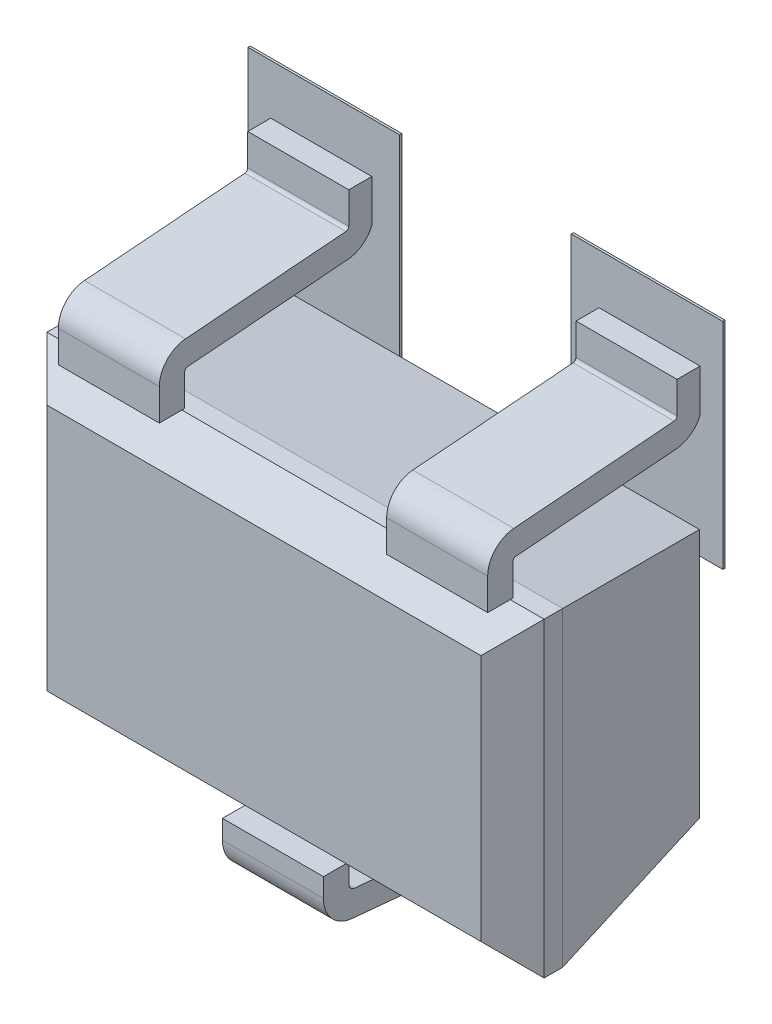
ISO-10303-21;
HEADER;
FILE_DESCRIPTION(('STEP AP214'),'2;1');
FILE_NAME('part.step','',(''),(''),'','','');
FILE_SCHEMA(('AUTOMOTIVE_DESIGN { 1 0 10303 214 1 1 1 1 }'));
ENDSEC;
DATA;
#1=APPLICATION_CONTEXT('core data for automotive mechanical design processes');
#2=APPLICATION_PROTOCOL_DEFINITION('international standard','automotive_design',2000,#1);
#3=PRODUCT_CONTEXT('',#1,'mechanical');
#4=PRODUCT('Part','Part','',(#3));
#5=PRODUCT_RELATED_PRODUCT_CATEGORY('part','',(#4));
#6=PRODUCT_DEFINITION_FORMATION('','',#4);
#7=PRODUCT_DEFINITION_CONTEXT('part definition',#1,'design');
#8=PRODUCT_DEFINITION('design','',#6,#7);
#9=PRODUCT_DEFINITION_SHAPE('','',#8);
#10=(LENGTH_UNIT() NAMED_UNIT(*) SI_UNIT(.MILLI.,.METRE.));
#11=(NAMED_UNIT(*) PLANE_ANGLE_UNIT() SI_UNIT($,.RADIAN.));
#12=(NAMED_UNIT(*) SI_UNIT($,.STERADIAN.) SOLID_ANGLE_UNIT());
#13=UNCERTAINTY_MEASURE_WITH_UNIT(LENGTH_MEASURE(1.E-05),#10,'distance_accuracy_value','');
#14=(GEOMETRIC_REPRESENTATION_CONTEXT(3) GLOBAL_UNCERTAINTY_ASSIGNED_CONTEXT((#13)) GLOBAL_UNIT_ASSIGNED_CONTEXT((#10,
#11,#12)) REPRESENTATION_CONTEXT('',''));
#15=CARTESIAN_POINT('',(0.,0.,0.));
#16=DIRECTION('',(0.,0.,1.));
#17=DIRECTION('',(1.,0.,0.));
#18=AXIS2_PLACEMENT_3D('',#15,#16,#17);
#19=CARTESIAN_POINT('',(-0.2032,-0.91329000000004,0.0762));
#20=DIRECTION('',(0.,0.,-1.));
#21=DIRECTION('',(-1.,0.,0.));
#22=AXIS2_PLACEMENT_3D('',#19,#20,#21);
#23=PLANE('',#22);
#24=DIRECTION('',(0.,1.,0.));
#25=VECTOR('',#24,1.);
#26=CARTESIAN_POINT('',(-0.95499999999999,1.25800000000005,0.0762));
#27=LINE('',#26,#25);
#28=CARTESIAN_POINT('',(-0.95499999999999,1.25800000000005,0.0762));
#29=VERTEX_POINT('',#28);
#30=CARTESIAN_POINT('',(-0.95499999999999,0.393999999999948,0.0762));
#31=VERTEX_POINT('',#30);
#32=EDGE_CURVE('E756',#29,#31,#27,.F.);
#33=ORIENTED_EDGE('',*,*,#32,.F.);
#34=DIRECTION('',(1.,0.,0.));
#35=VECTOR('',#34,1.);
#36=CARTESIAN_POINT('',(-0.34499999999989,1.25800000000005,0.0762));
#37=LINE('',#36,#35);
#38=CARTESIAN_POINT('',(-0.34499999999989,1.25800000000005,0.0762));
#39=VERTEX_POINT('',#38);
#40=EDGE_CURVE('E738',#39,#29,#37,.F.);
#41=ORIENTED_EDGE('',*,*,#40,.F.);
#42=DIRECTION('',(0.,1.,0.));
#43=VECTOR('',#42,1.);
#44=CARTESIAN_POINT('',(-0.34499999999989,0.393999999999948,0.0762));
#45=LINE('',#44,#43);
#46=CARTESIAN_POINT('',(-0.34499999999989,0.393999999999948,0.0762));
#47=VERTEX_POINT('',#46);
#48=EDGE_CURVE('E746',#47,#39,#45,.T.);
#49=ORIENTED_EDGE('',*,*,#48,.F.);
#50=DIRECTION('',(1.,0.,0.));
#51=VECTOR('',#50,1.);
#52=CARTESIAN_POINT('',(-0.95499999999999,0.393999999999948,0.0762));
#53=LINE('',#52,#51);
#54=EDGE_CURVE('E751',#31,#47,#53,.T.);
#55=ORIENTED_EDGE('',*,*,#54,.F.);
#56=EDGE_LOOP('',(#33,#41,#49,#55));
#57=FACE_BOUND('',#56,.T.);
#58=ADVANCED_FACE('F16',(#57),#23,.T.);
#59=CARTESIAN_POINT('',(-0.2032,-0.91329000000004,0.0762));
#60=DIRECTION('',(0.,0.,-1.));
#61=DIRECTION('',(-1.,0.,0.));
#62=AXIS2_PLACEMENT_3D('',#59,#60,#61);
#63=PLANE('',#62);
#64=DIRECTION('',(1.,0.,0.));
#65=VECTOR('',#64,1.);
#66=CARTESIAN_POINT('',(0.34499999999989,0.393999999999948,0.0762));
#67=LINE('',#66,#65);
#68=CARTESIAN_POINT('',(0.34499999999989,0.393999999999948,0.0762));
#69=VERTEX_POINT('',#68);
#70=CARTESIAN_POINT('',(0.95499999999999,0.393999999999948,0.0762));
#71=VERTEX_POINT('',#70);
#72=EDGE_CURVE('E736',#69,#71,#67,.T.);
#73=ORIENTED_EDGE('',*,*,#72,.F.);
#74=DIRECTION('',(0.,1.,0.));
#75=VECTOR('',#74,1.);
#76=CARTESIAN_POINT('',(0.34499999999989,1.25800000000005,0.0762));
#77=LINE('',#76,#75);
#78=CARTESIAN_POINT('',(0.34499999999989,1.25800000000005,0.0762));
#79=VERTEX_POINT('',#78);
#80=EDGE_CURVE('E709',#79,#69,#77,.F.);
#81=ORIENTED_EDGE('',*,*,#80,.F.);
#82=DIRECTION('',(1.,0.,0.));
#83=VECTOR('',#82,1.);
#84=CARTESIAN_POINT('',(0.95499999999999,1.25800000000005,0.0762));
#85=LINE('',#84,#83);
#86=CARTESIAN_POINT('',(0.95499999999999,1.25800000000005,0.0762));
#87=VERTEX_POINT('',#86);
#88=EDGE_CURVE('E726',#87,#79,#85,.F.);
#89=ORIENTED_EDGE('',*,*,#88,.F.);
#90=DIRECTION('',(0.,1.,0.));
#91=VECTOR('',#90,1.);
#92=CARTESIAN_POINT('',(0.95499999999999,0.393999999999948,0.0762));
#93=LINE('',#92,#91);
#94=EDGE_CURVE('E731',#71,#87,#93,.T.);
#95=ORIENTED_EDGE('',*,*,#94,.F.);
#96=EDGE_LOOP('',(#73,#81,#89,#95));
#97=FACE_BOUND('',#96,.T.);
#98=ADVANCED_FACE('F1276',(#97),#63,.T.);
#99=CARTESIAN_POINT('',(-0.2032,-0.91329000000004,0.0762));
#100=DIRECTION('',(0.,0.,-1.));
#101=DIRECTION('',(-1.,0.,0.));
#102=AXIS2_PLACEMENT_3D('',#99,#100,#101);
#103=PLANE('',#102);
#104=DIRECTION('',(1.,0.,0.));
#105=VECTOR('',#104,1.);
#106=CARTESIAN_POINT('',(-0.30500000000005,-1.25100000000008,0.0762));
#107=LINE('',#106,#105);
#108=CARTESIAN_POINT('',(-0.30500000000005,-1.25100000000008,0.0762));
#109=VERTEX_POINT('',#108);
#110=CARTESIAN_POINT('',(0.30500000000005,-1.25100000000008,0.0762));
#111=VERTEX_POINT('',#110);
#112=EDGE_CURVE('E707',#109,#111,#107,.T.);
#113=ORIENTED_EDGE('',*,*,#112,.F.);
#114=DIRECTION('',(0.,1.,0.));
#115=VECTOR('',#114,1.);
#116=CARTESIAN_POINT('',(-0.30500000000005,-0.386999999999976,0.0762));
#117=LINE('',#116,#115);
#118=CARTESIAN_POINT('',(-0.30500000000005,-0.386999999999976,0.0762));
#119=VERTEX_POINT('',#118);
#120=EDGE_CURVE('E688',#119,#109,#117,.F.);
#121=ORIENTED_EDGE('',*,*,#120,.F.);
#122=DIRECTION('',(1.,0.,0.));
#123=VECTOR('',#122,1.);
#124=CARTESIAN_POINT('',(0.30500000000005,-0.386999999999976,0.0762));
#125=LINE('',#124,#123);
#126=CARTESIAN_POINT('',(0.30500000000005,-0.386999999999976,0.0762));
#127=VERTEX_POINT('',#126);
#128=EDGE_CURVE('E697',#127,#119,#125,.F.);
#129=ORIENTED_EDGE('',*,*,#128,.F.);
#130=DIRECTION('',(0.,1.,0.));
#131=VECTOR('',#130,1.);
#132=CARTESIAN_POINT('',(0.30500000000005,-1.25100000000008,0.0762));
#133=LINE('',#132,#131);
#134=EDGE_CURVE('E702',#111,#127,#133,.T.);
#135=ORIENTED_EDGE('',*,*,#134,.F.);
#136=EDGE_LOOP('',(#113,#121,#129,#135));
#137=FACE_BOUND('',#136,.T.);
#138=ADVANCED_FACE('F1273',(#137),#103,.T.);
#139=CARTESIAN_POINT('',(-0.95499999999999,1.25800000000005,0.0762));
#140=DIRECTION('',(-1.,0.,0.));
#141=DIRECTION('',(0.,0.,1.));
#142=AXIS2_PLACEMENT_3D('',#139,#140,#141);
#143=PLANE('',#142);
#144=DIRECTION('',(0.,0.,1.));
#145=VECTOR('',#144,1.);
#146=CARTESIAN_POINT('',(-0.95499999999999,1.25800000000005,0.0762));
#147=LINE('',#146,#145);
#148=CARTESIAN_POINT('',(-0.95499999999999,1.25800000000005,0.0851999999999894));
#149=VERTEX_POINT('',#148);
#150=EDGE_CURVE('E744',#29,#149,#147,.T.);
#151=ORIENTED_EDGE('',*,*,#150,.F.);
#152=ORIENTED_EDGE('',*,*,#32,.T.);
#153=DIRECTION('',(0.,0.,-1.));
#154=VECTOR('',#153,1.);
#155=CARTESIAN_POINT('',(-0.95499999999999,0.393999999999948,0.0762));
#156=LINE('',#155,#154);
#157=CARTESIAN_POINT('',(-0.95499999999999,0.393999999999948,0.0851999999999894));
#158=VERTEX_POINT('',#157);
#159=EDGE_CURVE('E753',#158,#31,#156,.T.);
#160=ORIENTED_EDGE('',*,*,#159,.F.);
#161=DIRECTION('',(0.,1.,0.));
#162=VECTOR('',#161,1.);
#163=CARTESIAN_POINT('',(-0.95499999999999,0.,0.0851999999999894));
#164=LINE('',#163,#162);
#165=EDGE_CURVE('E399',#149,#158,#164,.F.);
#166=ORIENTED_EDGE('',*,*,#165,.F.);
#167=EDGE_LOOP('',(#151,#152,#160,#166));
#168=FACE_BOUND('',#167,.T.);
#169=ADVANCED_FACE('F1269',(#168),#143,.T.);
#170=CARTESIAN_POINT('',(-0.95499999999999,0.393999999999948,0.0762));
#171=DIRECTION('',(0.,-1.,0.));
#172=DIRECTION('',(0.,0.,-1.));
#173=AXIS2_PLACEMENT_3D('',#170,#171,#172);
#174=PLANE('',#173);
#175=ORIENTED_EDGE('',*,*,#159,.T.);
#176=ORIENTED_EDGE('',*,*,#54,.T.);
#177=DIRECTION('',(0.,0.,-1.));
#178=VECTOR('',#177,1.);
#179=CARTESIAN_POINT('',(-0.34499999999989,0.393999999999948,0.0762));
#180=LINE('',#179,#178);
#181=CARTESIAN_POINT('',(-0.34499999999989,0.393999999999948,0.0851999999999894));
#182=VERTEX_POINT('',#181);
#183=EDGE_CURVE('E748',#182,#47,#180,.T.);
#184=ORIENTED_EDGE('',*,*,#183,.F.);
#185=DIRECTION('',(1.,0.,0.));
#186=VECTOR('',#185,1.);
#187=CARTESIAN_POINT('',(0.,0.393999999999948,0.0851999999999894));
#188=LINE('',#187,#186);
#189=EDGE_CURVE('E614',#158,#182,#188,.T.);
#190=ORIENTED_EDGE('',*,*,#189,.F.);
#191=EDGE_LOOP('',(#175,#176,#184,#190));
#192=FACE_BOUND('',#191,.T.);
#193=ADVANCED_FACE('F1265',(#192),#174,.T.);
#194=CARTESIAN_POINT('',(-0.34499999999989,0.393999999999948,0.0762));
#195=DIRECTION('',(1.,0.,0.));
#196=DIRECTION('',(0.,0.,-1.));
#197=AXIS2_PLACEMENT_3D('',#194,#195,#196);
#198=PLANE('',#197);
#199=ORIENTED_EDGE('',*,*,#183,.T.);
#200=ORIENTED_EDGE('',*,*,#48,.T.);
#201=DIRECTION('',(0.,0.,1.));
#202=VECTOR('',#201,1.);
#203=CARTESIAN_POINT('',(-0.34499999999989,1.25800000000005,0.0762));
#204=LINE('',#203,#202);
#205=CARTESIAN_POINT('',(-0.34499999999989,1.25800000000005,0.0851999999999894));
#206=VERTEX_POINT('',#205);
#207=EDGE_CURVE('E741',#206,#39,#204,.F.);
#208=ORIENTED_EDGE('',*,*,#207,.F.);
#209=DIRECTION('',(0.,1.,0.));
#210=VECTOR('',#209,1.);
#211=CARTESIAN_POINT('',(-0.34499999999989,0.,0.0851999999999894));
#212=LINE('',#211,#210);
#213=EDGE_CURVE('E612',#182,#206,#212,.T.);
#214=ORIENTED_EDGE('',*,*,#213,.F.);
#215=EDGE_LOOP('',(#199,#200,#208,#214));
#216=FACE_BOUND('',#215,.T.);
#217=ADVANCED_FACE('F1261',(#216),#198,.T.);
#218=CARTESIAN_POINT('',(-0.34499999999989,1.25800000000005,0.0762));
#219=DIRECTION('',(0.,1.,0.));
#220=DIRECTION('',(0.,0.,1.));
#221=AXIS2_PLACEMENT_3D('',#218,#219,#220);
#222=PLANE('',#221);
#223=ORIENTED_EDGE('',*,*,#207,.T.);
#224=ORIENTED_EDGE('',*,*,#40,.T.);
#225=ORIENTED_EDGE('',*,*,#150,.T.);
#226=DIRECTION('',(1.,0.,0.));
#227=VECTOR('',#226,1.);
#228=CARTESIAN_POINT('',(0.,1.25800000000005,0.0851999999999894));
#229=LINE('',#228,#227);
#230=EDGE_CURVE('E609',#206,#149,#229,.F.);
#231=ORIENTED_EDGE('',*,*,#230,.F.);
#232=EDGE_LOOP('',(#223,#224,#225,#231));
#233=FACE_BOUND('',#232,.T.);
#234=ADVANCED_FACE('F1257',(#233),#222,.T.);
#235=CARTESIAN_POINT('',(0.34499999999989,0.393999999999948,0.0762));
#236=DIRECTION('',(0.,-1.,0.));
#237=DIRECTION('',(0.,0.,-1.));
#238=AXIS2_PLACEMENT_3D('',#235,#236,#237);
#239=PLANE('',#238);
#240=DIRECTION('',(0.,0.,1.));
#241=VECTOR('',#240,1.);
#242=CARTESIAN_POINT('',(0.34499999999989,0.393999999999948,0.0762));
#243=LINE('',#242,#241);
#244=CARTESIAN_POINT('',(0.34499999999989,0.393999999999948,0.0851999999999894));
#245=VERTEX_POINT('',#244);
#246=EDGE_CURVE('E724',#69,#245,#243,.T.);
#247=ORIENTED_EDGE('',*,*,#246,.F.);
#248=ORIENTED_EDGE('',*,*,#72,.T.);
#249=DIRECTION('',(0.,0.,-1.));
#250=VECTOR('',#249,1.);
#251=CARTESIAN_POINT('',(0.95499999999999,0.393999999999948,0.0762));
#252=LINE('',#251,#250);
#253=CARTESIAN_POINT('',(0.95499999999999,0.393999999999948,0.0851999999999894));
#254=VERTEX_POINT('',#253);
#255=EDGE_CURVE('E733',#254,#71,#252,.T.);
#256=ORIENTED_EDGE('',*,*,#255,.F.);
#257=DIRECTION('',(1.,0.,0.));
#258=VECTOR('',#257,1.);
#259=CARTESIAN_POINT('',(0.,0.393999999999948,0.0851999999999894));
#260=LINE('',#259,#258);
#261=EDGE_CURVE('E579',#245,#254,#260,.T.);
#262=ORIENTED_EDGE('',*,*,#261,.F.);
#263=EDGE_LOOP('',(#247,#248,#256,#262));
#264=FACE_BOUND('',#263,.T.);
#265=ADVANCED_FACE('F1253',(#264),#239,.T.);
#266=CARTESIAN_POINT('',(0.95499999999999,0.393999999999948,0.0762));
#267=DIRECTION('',(1.,0.,0.));
#268=DIRECTION('',(0.,0.,-1.));
#269=AXIS2_PLACEMENT_3D('',#266,#267,#268);
#270=PLANE('',#269);
#271=ORIENTED_EDGE('',*,*,#255,.T.);
#272=ORIENTED_EDGE('',*,*,#94,.T.);
#273=DIRECTION('',(0.,0.,1.));
#274=VECTOR('',#273,1.);
#275=CARTESIAN_POINT('',(0.95499999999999,1.25800000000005,0.0762));
#276=LINE('',#275,#274);
#277=CARTESIAN_POINT('',(0.95499999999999,1.25800000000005,0.0851999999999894));
#278=VERTEX_POINT('',#277);
#279=EDGE_CURVE('E728',#278,#87,#276,.F.);
#280=ORIENTED_EDGE('',*,*,#279,.F.);
#281=DIRECTION('',(0.,1.,0.));
#282=VECTOR('',#281,1.);
#283=CARTESIAN_POINT('',(0.95499999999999,0.,0.0851999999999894));
#284=LINE('',#283,#282);
#285=EDGE_CURVE('E577',#254,#278,#284,.T.);
#286=ORIENTED_EDGE('',*,*,#285,.F.);
#287=EDGE_LOOP('',(#271,#272,#280,#286));
#288=FACE_BOUND('',#287,.T.);
#289=ADVANCED_FACE('F1249',(#288),#270,.T.);
#290=CARTESIAN_POINT('',(0.95499999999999,1.25800000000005,0.0762));
#291=DIRECTION('',(0.,1.,0.));
#292=DIRECTION('',(0.,0.,1.));
#293=AXIS2_PLACEMENT_3D('',#290,#291,#292);
#294=PLANE('',#293);
#295=ORIENTED_EDGE('',*,*,#279,.T.);
#296=ORIENTED_EDGE('',*,*,#88,.T.);
#297=DIRECTION('',(0.,0.,1.));
#298=VECTOR('',#297,1.);
#299=CARTESIAN_POINT('',(0.34499999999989,1.25800000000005,0.0762));
#300=LINE('',#299,#298);
#301=CARTESIAN_POINT('',(0.34499999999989,1.25800000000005,0.0851999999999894));
#302=VERTEX_POINT('',#301);
#303=EDGE_CURVE('E721',#302,#79,#300,.F.);
#304=ORIENTED_EDGE('',*,*,#303,.F.);
#305=DIRECTION('',(1.,0.,0.));
#306=VECTOR('',#305,1.);
#307=CARTESIAN_POINT('',(0.,1.25800000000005,0.0851999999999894));
#308=LINE('',#307,#306);
#309=EDGE_CURVE('E575',#278,#302,#308,.F.);
#310=ORIENTED_EDGE('',*,*,#309,.F.);
#311=EDGE_LOOP('',(#295,#296,#304,#310));
#312=FACE_BOUND('',#311,.T.);
#313=ADVANCED_FACE('F1245',(#312),#294,.T.);
#314=CARTESIAN_POINT('',(0.34499999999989,1.25800000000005,0.0762));
#315=DIRECTION('',(-1.,0.,0.));
#316=DIRECTION('',(0.,0.,1.));
#317=AXIS2_PLACEMENT_3D('',#314,#315,#316);
#318=PLANE('',#317);
#319=ORIENTED_EDGE('',*,*,#303,.T.);
#320=ORIENTED_EDGE('',*,*,#80,.T.);
#321=ORIENTED_EDGE('',*,*,#246,.T.);
#322=DIRECTION('',(0.,1.,0.));
#323=VECTOR('',#322,1.);
#324=CARTESIAN_POINT('',(0.34499999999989,0.,0.0851999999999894));
#325=LINE('',#324,#323);
#326=EDGE_CURVE('E572',#302,#245,#325,.F.);
#327=ORIENTED_EDGE('',*,*,#326,.F.);
#328=EDGE_LOOP('',(#319,#320,#321,#327));
#329=FACE_BOUND('',#328,.T.);
#330=ADVANCED_FACE('F1241',(#329),#318,.T.);
#331=CARTESIAN_POINT('',(-0.30500000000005,-1.25100000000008,0.0762));
#332=DIRECTION('',(0.,-1.,0.));
#333=DIRECTION('',(0.,0.,-1.));
#334=AXIS2_PLACEMENT_3D('',#331,#332,#333);
#335=PLANE('',#334);
#336=DIRECTION('',(0.,0.,1.));
#337=VECTOR('',#336,1.);
#338=CARTESIAN_POINT('',(-0.30500000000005,-1.25100000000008,0.0762));
#339=LINE('',#338,#337);
#340=CARTESIAN_POINT('',(-0.30500000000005,-1.25100000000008,0.0851999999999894));
#341=VERTEX_POINT('',#340);
#342=EDGE_CURVE('E695',#109,#341,#339,.T.);
#343=ORIENTED_EDGE('',*,*,#342,.F.);
#344=ORIENTED_EDGE('',*,*,#112,.T.);
#345=DIRECTION('',(0.,0.,-1.));
#346=VECTOR('',#345,1.);
#347=CARTESIAN_POINT('',(0.30500000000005,-1.25100000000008,0.0762));
#348=LINE('',#347,#346);
#349=CARTESIAN_POINT('',(0.30500000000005,-1.25100000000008,0.0851999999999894));
#350=VERTEX_POINT('',#349);
#351=EDGE_CURVE('E704',#350,#111,#348,.T.);
#352=ORIENTED_EDGE('',*,*,#351,.F.);
#353=DIRECTION('',(1.,0.,0.));
#354=VECTOR('',#353,1.);
#355=CARTESIAN_POINT('',(0.,-1.25100000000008,0.0851999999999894));
#356=LINE('',#355,#354);
#357=EDGE_CURVE('E426',#341,#350,#356,.T.);
#358=ORIENTED_EDGE('',*,*,#357,.F.);
#359=EDGE_LOOP('',(#343,#344,#352,#358));
#360=FACE_BOUND('',#359,.T.);
#361=ADVANCED_FACE('F1237',(#360),#335,.T.);
#362=CARTESIAN_POINT('',(0.30500000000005,-1.25100000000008,0.0762));
#363=DIRECTION('',(1.,0.,0.));
#364=DIRECTION('',(0.,0.,-1.));
#365=AXIS2_PLACEMENT_3D('',#362,#363,#364);
#366=PLANE('',#365);
#367=ORIENTED_EDGE('',*,*,#351,.T.);
#368=ORIENTED_EDGE('',*,*,#134,.T.);
#369=DIRECTION('',(0.,0.,1.));
#370=VECTOR('',#369,1.);
#371=CARTESIAN_POINT('',(0.30500000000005,-0.386999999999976,0.0762));
#372=LINE('',#371,#370);
#373=CARTESIAN_POINT('',(0.30500000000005,-0.386999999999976,0.0851999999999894));
#374=VERTEX_POINT('',#373);
#375=EDGE_CURVE('E699',#374,#127,#372,.F.);
#376=ORIENTED_EDGE('',*,*,#375,.F.);
#377=DIRECTION('',(0.,1.,0.));
#378=VECTOR('',#377,1.);
#379=CARTESIAN_POINT('',(0.30500000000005,0.,0.0851999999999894));
#380=LINE('',#379,#378);
#381=EDGE_CURVE('E424',#350,#374,#380,.T.);
#382=ORIENTED_EDGE('',*,*,#381,.F.);
#383=EDGE_LOOP('',(#367,#368,#376,#382));
#384=FACE_BOUND('',#383,.T.);
#385=ADVANCED_FACE('F1233',(#384),#366,.T.);
#386=CARTESIAN_POINT('',(0.30500000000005,-0.386999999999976,0.0762));
#387=DIRECTION('',(0.,1.,0.));
#388=DIRECTION('',(0.,0.,1.));
#389=AXIS2_PLACEMENT_3D('',#386,#387,#388);
#390=PLANE('',#389);
#391=ORIENTED_EDGE('',*,*,#375,.T.);
#392=ORIENTED_EDGE('',*,*,#128,.T.);
#393=DIRECTION('',(0.,0.,1.));
#394=VECTOR('',#393,1.);
#395=CARTESIAN_POINT('',(-0.30500000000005,-0.386999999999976,0.0762));
#396=LINE('',#395,#394);
#397=CARTESIAN_POINT('',(-0.30500000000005,-0.386999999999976,0.0851999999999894));
#398=VERTEX_POINT('',#397);
#399=EDGE_CURVE('E692',#398,#119,#396,.F.);
#400=ORIENTED_EDGE('',*,*,#399,.F.);
#401=DIRECTION('',(1.,0.,0.));
#402=VECTOR('',#401,1.);
#403=CARTESIAN_POINT('',(0.,-0.386999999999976,0.0851999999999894));
#404=LINE('',#403,#402);
#405=EDGE_CURVE('E422',#374,#398,#404,.F.);
#406=ORIENTED_EDGE('',*,*,#405,.F.);
#407=EDGE_LOOP('',(#391,#392,#400,#406));
#408=FACE_BOUND('',#407,.T.);
#409=ADVANCED_FACE('F1229',(#408),#390,.T.);
#410=CARTESIAN_POINT('',(-0.30500000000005,-0.386999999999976,0.0762));
#411=DIRECTION('',(-1.,0.,0.));
#412=DIRECTION('',(0.,0.,1.));
#413=AXIS2_PLACEMENT_3D('',#410,#411,#412);
#414=PLANE('',#413);
#415=ORIENTED_EDGE('',*,*,#399,.T.);
#416=ORIENTED_EDGE('',*,*,#120,.T.);
#417=ORIENTED_EDGE('',*,*,#342,.T.);
#418=DIRECTION('',(0.,1.,0.));
#419=VECTOR('',#418,1.);
#420=CARTESIAN_POINT('',(-0.30500000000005,0.,0.0851999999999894));
#421=LINE('',#420,#419);
#422=EDGE_CURVE('E418',#398,#341,#421,.F.);
#423=ORIENTED_EDGE('',*,*,#422,.F.);
#424=EDGE_LOOP('',(#415,#416,#417,#423));
#425=FACE_BOUND('',#424,.T.);
#426=ADVANCED_FACE('F1225',(#425),#414,.T.);
#427=CARTESIAN_POINT('',(1.00000000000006,0.49800000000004,0.976122));
#428=DIRECTION('',(0.,-0.707106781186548,-0.707106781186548));
#429=DIRECTION('',(0.,0.707106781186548,-0.707106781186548));
#430=AXIS2_PLACEMENT_3D('',#427,#428,#429);
#431=PLANE('',#430);
#432=DIRECTION('',(1.,0.,0.));
#433=VECTOR('',#432,1.);
#434=CARTESIAN_POINT('',(1.00000000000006,0.62500000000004,0.849122));
#435=LINE('',#434,#433);
#436=CARTESIAN_POINT('',(0.8636,0.62500000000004,0.849122));
#437=VERTEX_POINT('',#436);
#438=CARTESIAN_POINT('',(0.4572,0.62500000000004,0.849122));
#439=VERTEX_POINT('',#438);
#440=EDGE_CURVE('E536',#437,#439,#435,.F.);
#441=ORIENTED_EDGE('',*,*,#440,.T.);
#442=DIRECTION('',(1.,0.,0.));
#443=VECTOR('',#442,1.);
#444=CARTESIAN_POINT('',(1.00000000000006,0.62500000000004,0.849122));
#445=LINE('',#444,#443);
#446=CARTESIAN_POINT('',(-0.4572,0.62500000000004,0.849122));
#447=VERTEX_POINT('',#446);
#448=EDGE_CURVE('E712',#447,#439,#445,.T.);
#449=ORIENTED_EDGE('',*,*,#448,.F.);
#450=DIRECTION('',(1.,0.,0.));
#451=VECTOR('',#450,1.);
#452=CARTESIAN_POINT('',(1.00000000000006,0.62500000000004,0.849122));
#453=LINE('',#452,#451);
#454=CARTESIAN_POINT('',(-0.863600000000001,0.62500000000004,0.849122));
#455=VERTEX_POINT('',#454);
#456=EDGE_CURVE('E628',#447,#455,#453,.F.);
#457=ORIENTED_EDGE('',*,*,#456,.T.);
#458=DIRECTION('',(1.,0.,0.));
#459=VECTOR('',#458,1.);
#460=CARTESIAN_POINT('',(1.00000000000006,0.62500000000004,0.849122));
#461=LINE('',#460,#459);
#462=CARTESIAN_POINT('',(-1.00000000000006,0.62500000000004,0.849122));
#463=VERTEX_POINT('',#462);
#464=EDGE_CURVE('E716',#463,#455,#461,.T.);
#465=ORIENTED_EDGE('',*,*,#464,.F.);
#466=DIRECTION('',(-0.577350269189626,0.577350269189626,-0.577350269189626));
#467=VECTOR('',#466,1.);
#468=CARTESIAN_POINT('',(-0.873000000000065,0.49800000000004,0.976122));
#469=LINE('',#468,#467);
#470=CARTESIAN_POINT('',(-0.873000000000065,0.49800000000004,0.976122));
#471=VERTEX_POINT('',#470);
#472=EDGE_CURVE('E759',#471,#463,#469,.T.);
#473=ORIENTED_EDGE('',*,*,#472,.F.);
#474=DIRECTION('',(1.,0.,0.));
#475=VECTOR('',#474,1.);
#476=CARTESIAN_POINT('',(0.,0.49800000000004,0.976122));
#477=LINE('',#476,#475);
#478=CARTESIAN_POINT('',(0.873000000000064,0.49800000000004,0.976122));
#479=VERTEX_POINT('',#478);
#480=EDGE_CURVE('E462',#479,#471,#477,.F.);
#481=ORIENTED_EDGE('',*,*,#480,.F.);
#482=DIRECTION('',(-0.577350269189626,-0.577350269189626,0.577350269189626));
#483=VECTOR('',#482,1.);
#484=CARTESIAN_POINT('',(1.00000000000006,0.62500000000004,0.849122));
#485=LINE('',#484,#483);
#486=CARTESIAN_POINT('',(1.00000000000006,0.62500000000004,0.849122));
#487=VERTEX_POINT('',#486);
#488=EDGE_CURVE('E691',#487,#479,#485,.T.);
#489=ORIENTED_EDGE('',*,*,#488,.F.);
#490=DIRECTION('',(1.,0.,0.));
#491=VECTOR('',#490,1.);
#492=CARTESIAN_POINT('',(1.00000000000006,0.62500000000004,0.849122));
#493=LINE('',#492,#491);
#494=EDGE_CURVE('E663',#437,#487,#493,.T.);
#495=ORIENTED_EDGE('',*,*,#494,.F.);
#496=EDGE_LOOP('',(#441,#449,#457,#465,#473,#481,#489,#495));
#497=FACE_BOUND('',#496,.T.);
#498=ADVANCED_FACE('F1221',(#497),#431,.F.);
#499=CARTESIAN_POINT('',(-0.6604,1.05680000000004,0.127));
#500=DIRECTION('',(0.,1.,0.));
#501=DIRECTION('',(0.,0.,1.));
#502=AXIS2_PLACEMENT_3D('',#499,#500,#501);
#503=PLANE('',#502);
#504=DIRECTION('',(0.,0.,-1.));
#505=VECTOR('',#504,1.);
#506=CARTESIAN_POINT('',(-0.4572,1.05680000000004,0.9398));
#507=LINE('',#506,#505);
#508=CARTESIAN_POINT('',(-0.4572,1.05680000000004,0.0851999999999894));
#509=VERTEX_POINT('',#508);
#510=CARTESIAN_POINT('',(-0.4572,1.05680000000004,0.1778));
#511=VERTEX_POINT('',#510);
#512=EDGE_CURVE('E621',#509,#511,#507,.F.);
#513=ORIENTED_EDGE('',*,*,#512,.F.);
#514=DIRECTION('',(1.,0.,0.));
#515=VECTOR('',#514,1.);
#516=CARTESIAN_POINT('',(0.,1.05680000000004,0.0851999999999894));
#517=LINE('',#516,#515);
#518=CARTESIAN_POINT('',(-0.8636,1.05680000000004,0.0851999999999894));
#519=VERTEX_POINT('',#518);
#520=EDGE_CURVE('E581',#519,#509,#517,.T.);
#521=ORIENTED_EDGE('',*,*,#520,.F.);
#522=DIRECTION('',(0.,0.,1.));
#523=VECTOR('',#522,1.);
#524=CARTESIAN_POINT('',(-0.8636,1.05680000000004,0.8382));
#525=LINE('',#524,#523);
#526=CARTESIAN_POINT('',(-0.8636,1.05680000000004,0.1778));
#527=VERTEX_POINT('',#526);
#528=EDGE_CURVE('E674',#527,#519,#525,.F.);
#529=ORIENTED_EDGE('',*,*,#528,.F.);
#530=DIRECTION('',(1.,0.,0.));
#531=VECTOR('',#530,1.);
#532=CARTESIAN_POINT('',(-0.8636,1.05680000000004,0.1778));
#533=LINE('',#532,#531);
#534=EDGE_CURVE('E661',#511,#527,#533,.F.);
#535=ORIENTED_EDGE('',*,*,#534,.F.);
#536=EDGE_LOOP('',(#513,#521,#529,#535));
#537=FACE_BOUND('',#536,.T.);
#538=ADVANCED_FACE('F1217',(#537),#503,.T.);
#539=CARTESIAN_POINT('',(-0.8636,0.92980000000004,0.1778));
#540=DIRECTION('',(0.,0.,1.));
#541=DIRECTION('',(1.,0.,0.));
#542=AXIS2_PLACEMENT_3D('',#539,#540,#541);
#543=PLANE('',#542);
#544=DIRECTION('',(0.,1.,0.));
#545=VECTOR('',#544,1.);
#546=CARTESIAN_POINT('',(-0.8636,0.62500000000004,0.1778));
#547=LINE('',#546,#545);
#548=CARTESIAN_POINT('',(-0.863599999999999,0.92980000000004,0.1778));
#549=VERTEX_POINT('',#548);
#550=EDGE_CURVE('E676',#549,#527,#547,.T.);
#551=ORIENTED_EDGE('',*,*,#550,.F.);
#552=DIRECTION('',(1.,0.,0.));
#553=VECTOR('',#552,1.);
#554=CARTESIAN_POINT('',(-26.0604,0.92980000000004,0.1778));
#555=LINE('',#554,#553);
#556=CARTESIAN_POINT('',(-0.457200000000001,0.92980000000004,0.1778));
#557=VERTEX_POINT('',#556);
#558=EDGE_CURVE('E658',#549,#557,#555,.T.);
#559=ORIENTED_EDGE('',*,*,#558,.T.);
#560=DIRECTION('',(0.,1.,0.));
#561=VECTOR('',#560,1.);
#562=CARTESIAN_POINT('',(-0.4572,0.62500000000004,0.1778));
#563=LINE('',#562,#561);
#564=EDGE_CURVE('E623',#511,#557,#563,.F.);
#565=ORIENTED_EDGE('',*,*,#564,.F.);
#566=ORIENTED_EDGE('',*,*,#534,.T.);
#567=EDGE_LOOP('',(#551,#559,#565,#566));
#568=FACE_BOUND('',#567,.T.);
#569=ADVANCED_FACE('F1213',(#568),#543,.T.);
#570=CARTESIAN_POINT('',(-26.0604,0.92980000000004,0.1905));
#571=DIRECTION('',(1.,0.,0.));
#572=DIRECTION('',(0.,0.,-1.));
#573=AXIS2_PLACEMENT_3D('',#570,#571,#572);
#574=CYLINDRICAL_SURFACE('',#573,0.0127);
#575=ORIENTED_EDGE('',*,*,#558,.F.);
#576=CARTESIAN_POINT('',(-0.863599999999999,0.92980000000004,0.1905));
#577=DIRECTION('',(1.,0.,0.));
#578=DIRECTION('',(0.,0.,-1.));
#579=AXIS2_PLACEMENT_3D('',#576,#577,#578);
#580=CIRCLE('',#579,0.0127);
#581=CARTESIAN_POINT('',(-0.863599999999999,0.917139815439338,0.189495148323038));
#582=VERTEX_POINT('',#581);
#583=EDGE_CURVE('E855',#582,#549,#580,.T.);
#584=ORIENTED_EDGE('',*,*,#583,.F.);
#585=DIRECTION('',(1.,0.,0.));
#586=VECTOR('',#585,1.);
#587=CARTESIAN_POINT('',(-0.8636,0.917139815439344,0.189495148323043));
#588=LINE('',#587,#586);
#589=CARTESIAN_POINT('',(-0.457200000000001,0.917139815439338,0.189495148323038));
#590=VERTEX_POINT('',#589);
#591=EDGE_CURVE('E656',#590,#582,#588,.F.);
#592=ORIENTED_EDGE('',*,*,#591,.F.);
#593=CARTESIAN_POINT('',(-0.457200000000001,0.92980000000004,0.1905));
#594=DIRECTION('',(1.,0.,0.));
#595=DIRECTION('',(0.,0.,-1.));
#596=AXIS2_PLACEMENT_3D('',#593,#594,#595);
#597=CIRCLE('',#596,0.0127);
#598=EDGE_CURVE('E853',#557,#590,#597,.F.);
#599=ORIENTED_EDGE('',*,*,#598,.F.);
#600=EDGE_LOOP('',(#575,#584,#592,#599));
#601=FACE_BOUND('',#600,.T.);
#602=ADVANCED_FACE('F1209',(#601),#574,.F.);
#603=CARTESIAN_POINT('',(-0.8636,0.865941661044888,0.83454366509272));
#604=DIRECTION('',(0.,0.996864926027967,0.0791221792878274));
#605=DIRECTION('',(0.,-0.0791221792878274,0.996864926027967));
#606=AXIS2_PLACEMENT_3D('',#603,#604,#605);
#607=PLANE('',#606);
#608=DIRECTION('',(0.,0.0791221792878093,-0.996864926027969));
#609=VECTOR('',#608,1.);
#610=CARTESIAN_POINT('',(-0.8636,0.865941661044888,0.83454366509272));
#611=LINE('',#610,#609);
#612=CARTESIAN_POINT('',(-0.863599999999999,0.865941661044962,0.834543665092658));
#613=VERTEX_POINT('',#612);
#614=EDGE_CURVE('E858',#613,#582,#611,.T.);
#615=ORIENTED_EDGE('',*,*,#614,.F.);
#616=DIRECTION('',(-1.,0.,0.));
#617=VECTOR('',#616,1.);
#618=CARTESIAN_POINT('',(24.7396,0.865941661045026,0.834543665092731));
#619=LINE('',#618,#617);
#620=CARTESIAN_POINT('',(-0.457200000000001,0.865941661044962,0.834543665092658));
#621=VERTEX_POINT('',#620);
#622=EDGE_CURVE('E643',#621,#613,#619,.T.);
#623=ORIENTED_EDGE('',*,*,#622,.F.);
#624=DIRECTION('',(0.,-0.0791221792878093,0.996864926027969));
#625=VECTOR('',#624,1.);
#626=CARTESIAN_POINT('',(-0.4572,0.917139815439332,0.189495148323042));
#627=LINE('',#626,#625);
#628=EDGE_CURVE('E852',#590,#621,#627,.T.);
#629=ORIENTED_EDGE('',*,*,#628,.F.);
#630=ORIENTED_EDGE('',*,*,#591,.T.);
#631=EDGE_LOOP('',(#615,#623,#629,#630));
#632=FACE_BOUND('',#631,.T.);
#633=ADVANCED_FACE('F1205',(#632),#607,.T.);
#634=CARTESIAN_POINT('',(24.7396,0.75200000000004,0.8255));
#635=DIRECTION('',(-1.,0.,0.));
#636=DIRECTION('',(0.,0.,1.));
#637=AXIS2_PLACEMENT_3D('',#634,#635,#636);
#638=CYLINDRICAL_SURFACE('',#637,0.1143);
#639=CARTESIAN_POINT('',(-0.863599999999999,0.75200000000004,0.8255));
#640=DIRECTION('',(-1.,0.,0.));
#641=DIRECTION('',(0.,0.,1.));
#642=AXIS2_PLACEMENT_3D('',#639,#640,#641);
#643=CIRCLE('',#642,0.1143);
#644=CARTESIAN_POINT('',(-0.863599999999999,0.75200000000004,0.9398));
#645=VERTEX_POINT('',#644);
#646=EDGE_CURVE('E859',#645,#613,#643,.T.);
#647=ORIENTED_EDGE('',*,*,#646,.F.);
#648=DIRECTION('',(1.,0.,0.));
#649=VECTOR('',#648,1.);
#650=CARTESIAN_POINT('',(-0.8636,0.75200000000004,0.9398));
#651=LINE('',#650,#649);
#652=CARTESIAN_POINT('',(-0.457200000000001,0.75200000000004,0.9398));
#653=VERTEX_POINT('',#652);
#654=EDGE_CURVE('E640',#653,#645,#651,.F.);
#655=ORIENTED_EDGE('',*,*,#654,.F.);
#656=CARTESIAN_POINT('',(-0.457200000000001,0.75200000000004,0.8255));
#657=DIRECTION('',(-1.,0.,0.));
#658=DIRECTION('',(0.,0.,1.));
#659=AXIS2_PLACEMENT_3D('',#656,#657,#658);
#660=CIRCLE('',#659,0.1143);
#661=EDGE_CURVE('E850',#621,#653,#660,.F.);
#662=ORIENTED_EDGE('',*,*,#661,.F.);
#663=ORIENTED_EDGE('',*,*,#622,.T.);
#664=EDGE_LOOP('',(#647,#655,#662,#663));
#665=FACE_BOUND('',#664,.T.);
#666=ADVANCED_FACE('F1201',(#665),#638,.T.);
#667=CARTESIAN_POINT('',(-0.8636,0.62500000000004,0.9398));
#668=DIRECTION('',(0.,0.,1.));
#669=DIRECTION('',(1.,0.,0.));
#670=AXIS2_PLACEMENT_3D('',#667,#668,#669);
#671=PLANE('',#670);
#672=DIRECTION('',(0.,1.,0.));
#673=VECTOR('',#672,1.);
#674=CARTESIAN_POINT('',(-0.8636,0.62500000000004,0.9398));
#675=LINE('',#674,#673);
#676=CARTESIAN_POINT('',(-0.8636,0.62500000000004,0.9398));
#677=VERTEX_POINT('',#676);
#678=EDGE_CURVE('E681',#677,#645,#675,.T.);
#679=ORIENTED_EDGE('',*,*,#678,.F.);
#680=DIRECTION('',(1.,0.,0.));
#681=VECTOR('',#680,1.);
#682=CARTESIAN_POINT('',(1.00000000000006,0.62500000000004,0.9398));
#683=LINE('',#682,#681);
#684=CARTESIAN_POINT('',(-0.4572,0.62500000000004,0.9398));
#685=VERTEX_POINT('',#684);
#686=EDGE_CURVE('E642',#677,#685,#683,.T.);
#687=ORIENTED_EDGE('',*,*,#686,.T.);
#688=DIRECTION('',(0.,1.,0.));
#689=VECTOR('',#688,1.);
#690=CARTESIAN_POINT('',(-0.4572,0.62500000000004,0.9398));
#691=LINE('',#690,#689);
#692=EDGE_CURVE('E652',#653,#685,#691,.F.);
#693=ORIENTED_EDGE('',*,*,#692,.F.);
#694=ORIENTED_EDGE('',*,*,#654,.T.);
#695=EDGE_LOOP('',(#679,#687,#693,#694));
#696=FACE_BOUND('',#695,.T.);
#697=ADVANCED_FACE('F1197',(#696),#671,.T.);
#698=CARTESIAN_POINT('',(1.00000000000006,0.62500000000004,0.849122));
#699=DIRECTION('',(0.,1.,0.));
#700=DIRECTION('',(0.,0.,1.));
#701=AXIS2_PLACEMENT_3D('',#698,#699,#700);
#702=PLANE('',#701);
#703=ORIENTED_EDGE('',*,*,#456,.F.);
#704=DIRECTION('',(0.,0.,-1.));
#705=VECTOR('',#704,1.);
#706=CARTESIAN_POINT('',(-0.4572,0.62500000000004,0.9398));
#707=LINE('',#706,#705);
#708=EDGE_CURVE('E648',#685,#447,#707,.T.);
#709=ORIENTED_EDGE('',*,*,#708,.F.);
#710=ORIENTED_EDGE('',*,*,#686,.F.);
#711=DIRECTION('',(0.,0.,1.));
#712=VECTOR('',#711,1.);
#713=CARTESIAN_POINT('',(-0.8636,0.62500000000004,0.8382));
#714=LINE('',#713,#712);
#715=EDGE_CURVE('E413',#455,#677,#714,.T.);
#716=ORIENTED_EDGE('',*,*,#715,.F.);
#717=EDGE_LOOP('',(#703,#709,#710,#716));
#718=FACE_BOUND('',#717,.T.);
#719=ADVANCED_FACE('F1193',(#718),#702,.F.);
#720=CARTESIAN_POINT('',(24.7396,0.75200000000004,0.8255));
#721=DIRECTION('',(-1.,0.,0.));
#722=DIRECTION('',(0.,0.,1.));
#723=AXIS2_PLACEMENT_3D('',#720,#721,#722);
#724=CYLINDRICAL_SURFACE('',#723,0.0127);
#725=DIRECTION('',(1.,0.,0.));
#726=VECTOR('',#725,1.);
#727=CARTESIAN_POINT('',(-0.4572,0.764660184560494,0.826504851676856));
#728=LINE('',#727,#726);
#729=CARTESIAN_POINT('',(-0.457200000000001,0.76466018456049,0.826504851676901));
#730=VERTEX_POINT('',#729);
#731=CARTESIAN_POINT('',(-0.863599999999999,0.76466018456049,0.826504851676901));
#732=VERTEX_POINT('',#731);
#733=EDGE_CURVE('E400',#730,#732,#728,.F.);
#734=ORIENTED_EDGE('',*,*,#733,.F.);
#735=CARTESIAN_POINT('',(-0.457200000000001,0.75200000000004,0.8255));
#736=DIRECTION('',(-1.,0.,0.));
#737=DIRECTION('',(0.,0.,1.));
#738=AXIS2_PLACEMENT_3D('',#735,#736,#737);
#739=CIRCLE('',#738,0.0127);
#740=CARTESIAN_POINT('',(-0.457200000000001,0.75200000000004,0.8382));
#741=VERTEX_POINT('',#740);
#742=EDGE_CURVE('E848',#741,#730,#739,.T.);
#743=ORIENTED_EDGE('',*,*,#742,.F.);
#744=DIRECTION('',(-1.,0.,0.));
#745=VECTOR('',#744,1.);
#746=CARTESIAN_POINT('',(-0.4572,0.75200000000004,0.8382));
#747=LINE('',#746,#745);
#748=CARTESIAN_POINT('',(-0.863599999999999,0.75200000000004,0.8382));
#749=VERTEX_POINT('',#748);
#750=EDGE_CURVE('E624',#749,#741,#747,.F.);
#751=ORIENTED_EDGE('',*,*,#750,.F.);
#752=CARTESIAN_POINT('',(-0.863599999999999,0.75200000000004,0.8255));
#753=DIRECTION('',(-1.,0.,0.));
#754=DIRECTION('',(0.,0.,1.));
#755=AXIS2_PLACEMENT_3D('',#752,#753,#754);
#756=CIRCLE('',#755,0.0127);
#757=EDGE_CURVE('E411',#732,#749,#756,.F.);
#758=ORIENTED_EDGE('',*,*,#757,.F.);
#759=EDGE_LOOP('',(#734,#743,#751,#758));
#760=FACE_BOUND('',#759,.T.);
#761=ADVANCED_FACE('F1190',(#760),#724,.F.);
#762=CARTESIAN_POINT('',(-0.4572,0.764660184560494,0.826504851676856));
#763=DIRECTION('',(0.,-0.996864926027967,-0.0791221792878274));
#764=DIRECTION('',(0.,0.0791221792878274,-0.996864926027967));
#765=AXIS2_PLACEMENT_3D('',#762,#763,#764);
#766=PLANE('',#765);
#767=DIRECTION('',(0.,0.0791221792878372,-0.996864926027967));
#768=VECTOR('',#767,1.);
#769=CARTESIAN_POINT('',(-0.4572,0.764660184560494,0.826504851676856));
#770=LINE('',#769,#768);
#771=CARTESIAN_POINT('',(-0.457200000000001,0.815858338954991,0.181456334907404));
#772=VERTEX_POINT('',#771);
#773=EDGE_CURVE('E847',#730,#772,#770,.T.);
#774=ORIENTED_EDGE('',*,*,#773,.F.);
#775=ORIENTED_EDGE('',*,*,#733,.T.);
#776=DIRECTION('',(0.,-0.0791221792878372,0.996864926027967));
#777=VECTOR('',#776,1.);
#778=CARTESIAN_POINT('',(-0.8636,0.815858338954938,0.181456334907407));
#779=LINE('',#778,#777);
#780=CARTESIAN_POINT('',(-0.863599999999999,0.815858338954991,0.181456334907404));
#781=VERTEX_POINT('',#780);
#782=EDGE_CURVE('E405',#781,#732,#779,.T.);
#783=ORIENTED_EDGE('',*,*,#782,.F.);
#784=DIRECTION('',(1.,0.,0.));
#785=VECTOR('',#784,1.);
#786=CARTESIAN_POINT('',(-26.0604,0.815858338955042,0.181456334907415));
#787=LINE('',#786,#785);
#788=EDGE_CURVE('E392',#772,#781,#787,.F.);
#789=ORIENTED_EDGE('',*,*,#788,.F.);
#790=EDGE_LOOP('',(#774,#775,#783,#789));
#791=FACE_BOUND('',#790,.T.);
#792=ADVANCED_FACE('F409',(#791),#766,.T.);
#793=CARTESIAN_POINT('',(-26.0604,0.92980000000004,0.1905));
#794=DIRECTION('',(1.,0.,0.));
#795=DIRECTION('',(0.,0.,-1.));
#796=AXIS2_PLACEMENT_3D('',#793,#794,#795);
#797=CYLINDRICAL_SURFACE('',#796,0.1143);
#798=CARTESIAN_POINT('',(-0.863599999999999,0.92980000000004,0.1905));
#799=DIRECTION('',(1.,0.,0.));
#800=DIRECTION('',(0.,0.,-1.));
#801=AXIS2_PLACEMENT_3D('',#798,#799,#800);
#802=CIRCLE('',#801,0.1143);
#803=CARTESIAN_POINT('',(-0.863599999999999,0.885343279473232,0.0851999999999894));
#804=VERTEX_POINT('',#803);
#805=EDGE_CURVE('E19',#804,#781,#802,.F.);
#806=ORIENTED_EDGE('',*,*,#805,.F.);
#807=DIRECTION('',(1.,0.,0.));
#808=VECTOR('',#807,1.);
#809=CARTESIAN_POINT('',(0.,0.885343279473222,0.0851999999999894));
#810=LINE('',#809,#808);
#811=CARTESIAN_POINT('',(-0.457200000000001,0.885343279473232,0.0851999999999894));
#812=VERTEX_POINT('',#811);
#813=EDGE_CURVE('E385',#812,#804,#810,.F.);
#814=ORIENTED_EDGE('',*,*,#813,.F.);
#815=CARTESIAN_POINT('',(-0.457200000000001,0.92980000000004,0.1905));
#816=DIRECTION('',(1.,0.,0.));
#817=DIRECTION('',(0.,0.,-1.));
#818=AXIS2_PLACEMENT_3D('',#815,#816,#817);
#819=CIRCLE('',#818,0.1143);
#820=EDGE_CURVE('E395',#772,#812,#819,.T.);
#821=ORIENTED_EDGE('',*,*,#820,.F.);
#822=ORIENTED_EDGE('',*,*,#788,.T.);
#823=EDGE_LOOP('',(#806,#814,#821,#822));
#824=FACE_BOUND('',#823,.T.);
#825=ADVANCED_FACE('F394',(#824),#797,.T.);
#826=CARTESIAN_POINT('',(0.,0.,0.0851999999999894));
#827=DIRECTION('',(0.,0.,1.));
#828=DIRECTION('',(1.,0.,0.));
#829=AXIS2_PLACEMENT_3D('',#826,#827,#828);
#830=PLANE('',#829);
#831=ORIENTED_EDGE('',*,*,#520,.T.);
#832=DIRECTION('',(0.,1.,0.));
#833=VECTOR('',#832,1.);
#834=CARTESIAN_POINT('',(-0.4572,0.62500000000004,0.0851999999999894));
#835=LINE('',#834,#833);
#836=EDGE_CURVE('E846',#812,#509,#835,.T.);
#837=ORIENTED_EDGE('',*,*,#836,.F.);
#838=ORIENTED_EDGE('',*,*,#813,.T.);
#839=DIRECTION('',(0.,1.,0.));
#840=VECTOR('',#839,1.);
#841=CARTESIAN_POINT('',(-0.8636,0.62500000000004,0.0851999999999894));
#842=LINE('',#841,#840);
#843=EDGE_CURVE('E407',#519,#804,#842,.F.);
#844=ORIENTED_EDGE('',*,*,#843,.F.);
#845=EDGE_LOOP('',(#831,#837,#838,#844));
#846=FACE_BOUND('',#845,.T.);
#847=ORIENTED_EDGE('',*,*,#213,.T.);
#848=ORIENTED_EDGE('',*,*,#230,.T.);
#849=ORIENTED_EDGE('',*,*,#165,.T.);
#850=ORIENTED_EDGE('',*,*,#189,.T.);
#851=EDGE_LOOP('',(#847,#848,#849,#850));
#852=FACE_BOUND('',#851,.T.);
#853=ADVANCED_FACE('F1182',(#846,#852),#830,.T.);
#854=CARTESIAN_POINT('',(0.,0.,0.0851999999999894));
#855=DIRECTION('',(0.,0.,1.));
#856=DIRECTION('',(1.,0.,0.));
#857=AXIS2_PLACEMENT_3D('',#854,#855,#856);
#858=PLANE('',#857);
#859=DIRECTION('',(1.,0.,0.));
#860=VECTOR('',#859,1.);
#861=CARTESIAN_POINT('',(26.0604,0.885343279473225,0.0851999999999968));
#862=LINE('',#861,#860);
#863=CARTESIAN_POINT('',(0.457200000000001,0.885343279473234,0.0851999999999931));
#864=VERTEX_POINT('',#863);
#865=CARTESIAN_POINT('',(0.863599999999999,0.885343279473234,0.0851999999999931));
#866=VERTEX_POINT('',#865);
#867=EDGE_CURVE('E570',#864,#866,#862,.T.);
#868=ORIENTED_EDGE('',*,*,#867,.F.);
#869=DIRECTION('',(0.,1.,0.));
#870=VECTOR('',#869,1.);
#871=CARTESIAN_POINT('',(0.4572,0.62500000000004,0.0851999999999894));
#872=LINE('',#871,#870);
#873=CARTESIAN_POINT('',(0.4572,1.05680000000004,0.0851999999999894));
#874=VERTEX_POINT('',#873);
#875=EDGE_CURVE('E606',#864,#874,#872,.T.);
#876=ORIENTED_EDGE('',*,*,#875,.T.);
#877=DIRECTION('',(1.,0.,0.));
#878=VECTOR('',#877,1.);
#879=CARTESIAN_POINT('',(0.6604,1.05680000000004,0.0851999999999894));
#880=LINE('',#879,#878);
#881=CARTESIAN_POINT('',(0.8636,1.05680000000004,0.0851999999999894));
#882=VERTEX_POINT('',#881);
#883=EDGE_CURVE('E517',#874,#882,#880,.T.);
#884=ORIENTED_EDGE('',*,*,#883,.T.);
#885=DIRECTION('',(0.,1.,0.));
#886=VECTOR('',#885,1.);
#887=CARTESIAN_POINT('',(0.8636,0.62500000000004,0.0851999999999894));
#888=LINE('',#887,#886);
#889=EDGE_CURVE('E561',#882,#866,#888,.F.);
#890=ORIENTED_EDGE('',*,*,#889,.T.);
#891=EDGE_LOOP('',(#868,#876,#884,#890));
#892=FACE_BOUND('',#891,.T.);
#893=ORIENTED_EDGE('',*,*,#309,.T.);
#894=ORIENTED_EDGE('',*,*,#326,.T.);
#895=ORIENTED_EDGE('',*,*,#261,.T.);
#896=ORIENTED_EDGE('',*,*,#285,.T.);
#897=EDGE_LOOP('',(#893,#894,#895,#896));
#898=FACE_BOUND('',#897,.T.);
#899=ADVANCED_FACE('F1178',(#892,#898),#858,.T.);
#900=CARTESIAN_POINT('',(26.0604,0.92980000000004,0.1905));
#901=DIRECTION('',(1.,0.,0.));
#902=DIRECTION('',(0.,0.,-1.));
#903=AXIS2_PLACEMENT_3D('',#900,#901,#902);
#904=CYLINDRICAL_SURFACE('',#903,0.1143);
#905=CARTESIAN_POINT('',(0.457200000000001,0.92980000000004,0.1905));
#906=DIRECTION('',(1.,0.,0.));
#907=DIRECTION('',(0.,0.,-1.));
#908=AXIS2_PLACEMENT_3D('',#905,#906,#907);
#909=CIRCLE('',#908,0.1143);
#910=CARTESIAN_POINT('',(0.457200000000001,0.815858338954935,0.181456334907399));
#911=VERTEX_POINT('',#910);
#912=EDGE_CURVE('E588',#911,#864,#909,.T.);
#913=ORIENTED_EDGE('',*,*,#912,.T.);
#914=ORIENTED_EDGE('',*,*,#867,.T.);
#915=CARTESIAN_POINT('',(0.863599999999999,0.92980000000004,0.1905));
#916=DIRECTION('',(1.,0.,0.));
#917=DIRECTION('',(0.,0.,-1.));
#918=AXIS2_PLACEMENT_3D('',#915,#916,#917);
#919=CIRCLE('',#918,0.1143);
#920=CARTESIAN_POINT('',(0.863599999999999,0.815858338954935,0.181456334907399));
#921=VERTEX_POINT('',#920);
#922=EDGE_CURVE('E830',#866,#921,#919,.F.);
#923=ORIENTED_EDGE('',*,*,#922,.T.);
#924=DIRECTION('',(1.,0.,0.));
#925=VECTOR('',#924,1.);
#926=CARTESIAN_POINT('',(0.4572,0.815858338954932,0.181456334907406));
#927=LINE('',#926,#925);
#928=EDGE_CURVE('E568',#921,#911,#927,.F.);
#929=ORIENTED_EDGE('',*,*,#928,.T.);
#930=EDGE_LOOP('',(#913,#914,#923,#929));
#931=FACE_BOUND('',#930,.T.);
#932=ADVANCED_FACE('F1174',(#931),#904,.T.);
#933=CARTESIAN_POINT('',(0.4572,0.764660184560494,0.826504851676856));
#934=DIRECTION('',(0.,0.996864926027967,0.0791221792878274));
#935=DIRECTION('',(0.,-0.0791221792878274,0.996864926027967));
#936=AXIS2_PLACEMENT_3D('',#933,#934,#935);
#937=PLANE('',#936);
#938=ORIENTED_EDGE('',*,*,#928,.F.);
#939=DIRECTION('',(0.,-0.0791221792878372,0.996864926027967));
#940=VECTOR('',#939,1.);
#941=CARTESIAN_POINT('',(0.8636,0.815858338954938,0.181456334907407));
#942=LINE('',#941,#940);
#943=CARTESIAN_POINT('',(0.863599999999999,0.764660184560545,0.826504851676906));
#944=VERTEX_POINT('',#943);
#945=EDGE_CURVE('E829',#921,#944,#942,.T.);
#946=ORIENTED_EDGE('',*,*,#945,.T.);
#947=DIRECTION('',(-1.,0.,0.));
#948=VECTOR('',#947,1.);
#949=CARTESIAN_POINT('',(-24.7396,0.764660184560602,0.826504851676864));
#950=LINE('',#949,#948);
#951=CARTESIAN_POINT('',(0.457200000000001,0.764660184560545,0.826504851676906));
#952=VERTEX_POINT('',#951);
#953=EDGE_CURVE('E548',#944,#952,#950,.T.);
#954=ORIENTED_EDGE('',*,*,#953,.T.);
#955=DIRECTION('',(0.,0.0791221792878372,-0.996864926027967));
#956=VECTOR('',#955,1.);
#957=CARTESIAN_POINT('',(0.4572,0.764660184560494,0.826504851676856));
#958=LINE('',#957,#956);
#959=EDGE_CURVE('E835',#952,#911,#958,.T.);
#960=ORIENTED_EDGE('',*,*,#959,.T.);
#961=EDGE_LOOP('',(#938,#946,#954,#960));
#962=FACE_BOUND('',#961,.T.);
#963=ADVANCED_FACE('F1170',(#962),#937,.F.);
#964=CARTESIAN_POINT('',(-24.7396,0.75200000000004,0.8255));
#965=DIRECTION('',(-1.,0.,0.));
#966=DIRECTION('',(0.,0.,1.));
#967=AXIS2_PLACEMENT_3D('',#964,#965,#966);
#968=CYLINDRICAL_SURFACE('',#967,0.0127);
#969=ORIENTED_EDGE('',*,*,#953,.F.);
#970=CARTESIAN_POINT('',(0.863599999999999,0.75200000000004,0.8255));
#971=DIRECTION('',(-1.,0.,0.));
#972=DIRECTION('',(0.,0.,1.));
#973=AXIS2_PLACEMENT_3D('',#970,#971,#972);
#974=CIRCLE('',#973,0.0127);
#975=CARTESIAN_POINT('',(0.863599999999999,0.75200000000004,0.8382));
#976=VERTEX_POINT('',#975);
#977=EDGE_CURVE('E826',#944,#976,#974,.F.);
#978=ORIENTED_EDGE('',*,*,#977,.T.);
#979=DIRECTION('',(1.,0.,0.));
#980=VECTOR('',#979,1.);
#981=CARTESIAN_POINT('',(0.4572,0.75200000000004,0.8382));
#982=LINE('',#981,#980);
#983=CARTESIAN_POINT('',(0.457200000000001,0.75200000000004,0.8382));
#984=VERTEX_POINT('',#983);
#985=EDGE_CURVE('E558',#976,#984,#982,.F.);
#986=ORIENTED_EDGE('',*,*,#985,.T.);
#987=CARTESIAN_POINT('',(0.457200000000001,0.75200000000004,0.8255));
#988=DIRECTION('',(-1.,0.,0.));
#989=DIRECTION('',(0.,0.,1.));
#990=AXIS2_PLACEMENT_3D('',#987,#988,#989);
#991=CIRCLE('',#990,0.0127);
#992=EDGE_CURVE('E598',#984,#952,#991,.T.);
#993=ORIENTED_EDGE('',*,*,#992,.T.);
#994=EDGE_LOOP('',(#969,#978,#986,#993));
#995=FACE_BOUND('',#994,.T.);
#996=ADVANCED_FACE('F1166',(#995),#968,.F.);
#997=CARTESIAN_POINT('',(1.00000000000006,0.62500000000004,0.849122));
#998=DIRECTION('',(0.,1.,0.));
#999=DIRECTION('',(0.,0.,1.));
#1000=AXIS2_PLACEMENT_3D('',#997,#998,#999);
#1001=PLANE('',#1000);
#1002=ORIENTED_EDGE('',*,*,#440,.F.);
#1003=DIRECTION('',(0.,0.,1.));
#1004=VECTOR('',#1003,1.);
#1005=CARTESIAN_POINT('',(0.8636,0.62500000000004,0.8382));
#1006=LINE('',#1005,#1004);
#1007=CARTESIAN_POINT('',(0.8636,0.62500000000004,0.9398));
#1008=VERTEX_POINT('',#1007);
#1009=EDGE_CURVE('E539',#437,#1008,#1006,.T.);
#1010=ORIENTED_EDGE('',*,*,#1009,.T.);
#1011=DIRECTION('',(-1.,0.,0.));
#1012=VECTOR('',#1011,1.);
#1013=CARTESIAN_POINT('',(0.8636,0.62500000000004,0.9398));
#1014=LINE('',#1013,#1012);
#1015=CARTESIAN_POINT('',(0.4572,0.62500000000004,0.9398));
#1016=VERTEX_POINT('',#1015);
#1017=EDGE_CURVE('E534',#1008,#1016,#1014,.T.);
#1018=ORIENTED_EDGE('',*,*,#1017,.T.);
#1019=DIRECTION('',(0.,0.,-1.));
#1020=VECTOR('',#1019,1.);
#1021=CARTESIAN_POINT('',(0.4572,0.62500000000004,0.9398));
#1022=LINE('',#1021,#1020);
#1023=EDGE_CURVE('E595',#1016,#439,#1022,.T.);
#1024=ORIENTED_EDGE('',*,*,#1023,.T.);
#1025=EDGE_LOOP('',(#1002,#1010,#1018,#1024));
#1026=FACE_BOUND('',#1025,.T.);
#1027=ADVANCED_FACE('F1162',(#1026),#1001,.F.);
#1028=CARTESIAN_POINT('',(0.8636,0.62500000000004,0.9398));
#1029=DIRECTION('',(0.,0.,-1.));
#1030=DIRECTION('',(-1.,0.,0.));
#1031=AXIS2_PLACEMENT_3D('',#1028,#1029,#1030);
#1032=PLANE('',#1031);
#1033=DIRECTION('',(-1.,0.,0.));
#1034=VECTOR('',#1033,1.);
#1035=CARTESIAN_POINT('',(-24.7396,0.75200000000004,0.9398));
#1036=LINE('',#1035,#1034);
#1037=CARTESIAN_POINT('',(0.457200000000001,0.75200000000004,0.9398));
#1038=VERTEX_POINT('',#1037);
#1039=CARTESIAN_POINT('',(0.863599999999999,0.75200000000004,0.9398));
#1040=VERTEX_POINT('',#1039);
#1041=EDGE_CURVE('E532',#1038,#1040,#1036,.F.);
#1042=ORIENTED_EDGE('',*,*,#1041,.F.);
#1043=DIRECTION('',(0.,1.,0.));
#1044=VECTOR('',#1043,1.);
#1045=CARTESIAN_POINT('',(0.4572,0.62500000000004,0.9398));
#1046=LINE('',#1045,#1044);
#1047=EDGE_CURVE('E599',#1038,#1016,#1046,.F.);
#1048=ORIENTED_EDGE('',*,*,#1047,.T.);
#1049=ORIENTED_EDGE('',*,*,#1017,.F.);
#1050=DIRECTION('',(0.,1.,0.));
#1051=VECTOR('',#1050,1.);
#1052=CARTESIAN_POINT('',(0.8636,0.62500000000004,0.9398));
#1053=LINE('',#1052,#1051);
#1054=EDGE_CURVE('E542',#1008,#1040,#1053,.T.);
#1055=ORIENTED_EDGE('',*,*,#1054,.T.);
#1056=EDGE_LOOP('',(#1042,#1048,#1049,#1055));
#1057=FACE_BOUND('',#1056,.T.);
#1058=ADVANCED_FACE('F1158',(#1057),#1032,.F.);
#1059=CARTESIAN_POINT('',(-24.7396,0.75200000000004,0.8255));
#1060=DIRECTION('',(-1.,0.,0.));
#1061=DIRECTION('',(0.,0.,1.));
#1062=AXIS2_PLACEMENT_3D('',#1059,#1060,#1061);
#1063=CYLINDRICAL_SURFACE('',#1062,0.1143);
#1064=CARTESIAN_POINT('',(0.457200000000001,0.75200000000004,0.8255));
#1065=DIRECTION('',(-1.,0.,0.));
#1066=DIRECTION('',(0.,0.,1.));
#1067=AXIS2_PLACEMENT_3D('',#1064,#1065,#1066);
#1068=CIRCLE('',#1067,0.1143);
#1069=CARTESIAN_POINT('',(0.457200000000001,0.865941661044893,0.834543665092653));
#1070=VERTEX_POINT('',#1069);
#1071=EDGE_CURVE('E838',#1070,#1038,#1068,.F.);
#1072=ORIENTED_EDGE('',*,*,#1071,.T.);
#1073=ORIENTED_EDGE('',*,*,#1041,.T.);
#1074=CARTESIAN_POINT('',(0.863599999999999,0.75200000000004,0.8255));
#1075=DIRECTION('',(-1.,0.,0.));
#1076=DIRECTION('',(0.,0.,1.));
#1077=AXIS2_PLACEMENT_3D('',#1074,#1075,#1076);
#1078=CIRCLE('',#1077,0.1143);
#1079=CARTESIAN_POINT('',(0.863599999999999,0.865941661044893,0.834543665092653));
#1080=VERTEX_POINT('',#1079);
#1081=EDGE_CURVE('E823',#1040,#1080,#1078,.T.);
#1082=ORIENTED_EDGE('',*,*,#1081,.T.);
#1083=DIRECTION('',(1.,0.,0.));
#1084=VECTOR('',#1083,1.);
#1085=CARTESIAN_POINT('',(0.8636,0.865941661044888,0.83454366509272));
#1086=LINE('',#1085,#1084);
#1087=EDGE_CURVE('E530',#1080,#1070,#1086,.F.);
#1088=ORIENTED_EDGE('',*,*,#1087,.T.);
#1089=EDGE_LOOP('',(#1072,#1073,#1082,#1088));
#1090=FACE_BOUND('',#1089,.T.);
#1091=ADVANCED_FACE('F1154',(#1090),#1063,.T.);
#1092=CARTESIAN_POINT('',(0.8636,0.865941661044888,0.83454366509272));
#1093=DIRECTION('',(0.,-0.996864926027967,-0.0791221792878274));
#1094=DIRECTION('',(0.,0.0791221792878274,-0.996864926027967));
#1095=AXIS2_PLACEMENT_3D('',#1092,#1093,#1094);
#1096=PLANE('',#1095);
#1097=DIRECTION('',(1.,0.,0.));
#1098=VECTOR('',#1097,1.);
#1099=CARTESIAN_POINT('',(26.0604,0.917139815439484,0.189495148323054));
#1100=LINE('',#1099,#1098);
#1101=CARTESIAN_POINT('',(0.863599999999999,0.917139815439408,0.189495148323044));
#1102=VERTEX_POINT('',#1101);
#1103=CARTESIAN_POINT('',(0.457200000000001,0.917139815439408,0.189495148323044));
#1104=VERTEX_POINT('',#1103);
#1105=EDGE_CURVE('E518',#1102,#1104,#1100,.F.);
#1106=ORIENTED_EDGE('',*,*,#1105,.T.);
#1107=DIRECTION('',(0.,-0.0791221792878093,0.996864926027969));
#1108=VECTOR('',#1107,1.);
#1109=CARTESIAN_POINT('',(0.4572,0.917139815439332,0.189495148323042));
#1110=LINE('',#1109,#1108);
#1111=EDGE_CURVE('E841',#1104,#1070,#1110,.T.);
#1112=ORIENTED_EDGE('',*,*,#1111,.T.);
#1113=ORIENTED_EDGE('',*,*,#1087,.F.);
#1114=DIRECTION('',(0.,0.0791221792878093,-0.996864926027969));
#1115=VECTOR('',#1114,1.);
#1116=CARTESIAN_POINT('',(0.8636,0.865941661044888,0.83454366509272));
#1117=LINE('',#1116,#1115);
#1118=EDGE_CURVE('E822',#1080,#1102,#1117,.T.);
#1119=ORIENTED_EDGE('',*,*,#1118,.T.);
#1120=EDGE_LOOP('',(#1106,#1112,#1113,#1119));
#1121=FACE_BOUND('',#1120,.T.);
#1122=ADVANCED_FACE('F1150',(#1121),#1096,.F.);
#1123=CARTESIAN_POINT('',(26.0604,0.92980000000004,0.1905));
#1124=DIRECTION('',(1.,0.,0.));
#1125=DIRECTION('',(0.,0.,-1.));
#1126=AXIS2_PLACEMENT_3D('',#1123,#1124,#1125);
#1127=CYLINDRICAL_SURFACE('',#1126,0.0127);
#1128=DIRECTION('',(-1.,0.,0.));
#1129=VECTOR('',#1128,1.);
#1130=CARTESIAN_POINT('',(0.8636,0.92980000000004,0.1778));
#1131=LINE('',#1130,#1129);
#1132=CARTESIAN_POINT('',(0.863599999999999,0.92980000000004,0.1778));
#1133=VERTEX_POINT('',#1132);
#1134=CARTESIAN_POINT('',(0.457200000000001,0.92980000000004,0.1778));
#1135=VERTEX_POINT('',#1134);
#1136=EDGE_CURVE('E515',#1133,#1135,#1131,.T.);
#1137=ORIENTED_EDGE('',*,*,#1136,.T.);
#1138=CARTESIAN_POINT('',(0.457200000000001,0.92980000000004,0.1905));
#1139=DIRECTION('',(1.,0.,0.));
#1140=DIRECTION('',(0.,0.,-1.));
#1141=AXIS2_PLACEMENT_3D('',#1138,#1139,#1140);
#1142=CIRCLE('',#1141,0.0127);
#1143=EDGE_CURVE('E842',#1135,#1104,#1142,.F.);
#1144=ORIENTED_EDGE('',*,*,#1143,.T.);
#1145=ORIENTED_EDGE('',*,*,#1105,.F.);
#1146=CARTESIAN_POINT('',(0.863599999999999,0.92980000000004,0.1905));
#1147=DIRECTION('',(1.,0.,0.));
#1148=DIRECTION('',(0.,0.,-1.));
#1149=AXIS2_PLACEMENT_3D('',#1146,#1147,#1148);
#1150=CIRCLE('',#1149,0.0127);
#1151=EDGE_CURVE('E819',#1102,#1133,#1150,.T.);
#1152=ORIENTED_EDGE('',*,*,#1151,.T.);
#1153=EDGE_LOOP('',(#1137,#1144,#1145,#1152));
#1154=FACE_BOUND('',#1153,.T.);
#1155=ADVANCED_FACE('F1146',(#1154),#1127,.F.);
#1156=CARTESIAN_POINT('',(0.8636,0.92980000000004,0.1778));
#1157=DIRECTION('',(0.,0.,-1.));
#1158=DIRECTION('',(-1.,0.,0.));
#1159=AXIS2_PLACEMENT_3D('',#1156,#1157,#1158);
#1160=PLANE('',#1159);
#1161=DIRECTION('',(1.,0.,0.));
#1162=VECTOR('',#1161,1.);
#1163=CARTESIAN_POINT('',(0.6604,1.05680000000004,0.1778));
#1164=LINE('',#1163,#1162);
#1165=CARTESIAN_POINT('',(0.8636,1.05680000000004,0.1778));
#1166=VERTEX_POINT('',#1165);
#1167=CARTESIAN_POINT('',(0.4572,1.05680000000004,0.1778));
#1168=VERTEX_POINT('',#1167);
#1169=EDGE_CURVE('E479',#1166,#1168,#1164,.F.);
#1170=ORIENTED_EDGE('',*,*,#1169,.T.);
#1171=DIRECTION('',(0.,1.,0.));
#1172=VECTOR('',#1171,1.);
#1173=CARTESIAN_POINT('',(0.4572,0.62500000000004,0.1778));
#1174=LINE('',#1173,#1172);
#1175=EDGE_CURVE('E605',#1168,#1135,#1174,.F.);
#1176=ORIENTED_EDGE('',*,*,#1175,.T.);
#1177=ORIENTED_EDGE('',*,*,#1136,.F.);
#1178=DIRECTION('',(0.,1.,0.));
#1179=VECTOR('',#1178,1.);
#1180=CARTESIAN_POINT('',(0.8636,0.62500000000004,0.1778));
#1181=LINE('',#1180,#1179);
#1182=EDGE_CURVE('E523',#1133,#1166,#1181,.T.);
#1183=ORIENTED_EDGE('',*,*,#1182,.T.);
#1184=EDGE_LOOP('',(#1170,#1176,#1177,#1183));
#1185=FACE_BOUND('',#1184,.T.);
#1186=ADVANCED_FACE('F1142',(#1185),#1160,.F.);
#1187=CARTESIAN_POINT('',(0.6604,1.05680000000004,0.127));
#1188=DIRECTION('',(0.,-1.,0.));
#1189=DIRECTION('',(0.,0.,-1.));
#1190=AXIS2_PLACEMENT_3D('',#1187,#1188,#1189);
#1191=PLANE('',#1190);
#1192=ORIENTED_EDGE('',*,*,#1169,.F.);
#1193=DIRECTION('',(0.,0.,1.));
#1194=VECTOR('',#1193,1.);
#1195=CARTESIAN_POINT('',(0.8636,1.05680000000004,0.8382));
#1196=LINE('',#1195,#1194);
#1197=EDGE_CURVE('E519',#1166,#882,#1196,.F.);
#1198=ORIENTED_EDGE('',*,*,#1197,.T.);
#1199=ORIENTED_EDGE('',*,*,#883,.F.);
#1200=DIRECTION('',(0.,0.,-1.));
#1201=VECTOR('',#1200,1.);
#1202=CARTESIAN_POINT('',(0.4572,1.05680000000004,0.9398));
#1203=LINE('',#1202,#1201);
#1204=EDGE_CURVE('E602',#874,#1168,#1203,.F.);
#1205=ORIENTED_EDGE('',*,*,#1204,.T.);
#1206=EDGE_LOOP('',(#1192,#1198,#1199,#1205));
#1207=FACE_BOUND('',#1206,.T.);
#1208=ADVANCED_FACE('F1138',(#1207),#1191,.F.);
#1209=CARTESIAN_POINT('',(0.,-1.05680000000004,0.127));
#1210=DIRECTION('',(0.,-1.,0.));
#1211=DIRECTION('',(0.,0.,-1.));
#1212=AXIS2_PLACEMENT_3D('',#1209,#1210,#1211);
#1213=PLANE('',#1212);
#1214=DIRECTION('',(0.,0.,1.));
#1215=VECTOR('',#1214,1.);
#1216=CARTESIAN_POINT('',(-0.2032,-1.05680000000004,0.9398));
#1217=LINE('',#1216,#1215);
#1218=CARTESIAN_POINT('',(-0.2032,-1.05680000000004,0.0851999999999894));
#1219=VERTEX_POINT('',#1218);
#1220=CARTESIAN_POINT('',(-0.2032,-1.05680000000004,0.1778));
#1221=VERTEX_POINT('',#1220);
#1222=EDGE_CURVE('E435',#1219,#1221,#1217,.T.);
#1223=ORIENTED_EDGE('',*,*,#1222,.F.);
#1224=DIRECTION('',(1.,0.,0.));
#1225=VECTOR('',#1224,1.);
#1226=CARTESIAN_POINT('',(0.,-1.05680000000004,0.0851999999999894));
#1227=LINE('',#1226,#1225);
#1228=CARTESIAN_POINT('',(0.2032,-1.05680000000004,0.0851999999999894));
#1229=VERTEX_POINT('',#1228);
#1230=EDGE_CURVE('E430',#1229,#1219,#1227,.F.);
#1231=ORIENTED_EDGE('',*,*,#1230,.F.);
#1232=DIRECTION('',(0.,0.,-1.));
#1233=VECTOR('',#1232,1.);
#1234=CARTESIAN_POINT('',(0.2032,-1.05680000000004,0.8382));
#1235=LINE('',#1234,#1233);
#1236=CARTESIAN_POINT('',(0.2032,-1.05680000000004,0.1778));
#1237=VERTEX_POINT('',#1236);
#1238=EDGE_CURVE('E491',#1237,#1229,#1235,.T.);
#1239=ORIENTED_EDGE('',*,*,#1238,.F.);
#1240=DIRECTION('',(1.,0.,0.));
#1241=VECTOR('',#1240,1.);
#1242=CARTESIAN_POINT('',(0.2032,-1.05680000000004,0.1778));
#1243=LINE('',#1242,#1241);
#1244=EDGE_CURVE('E477',#1221,#1237,#1243,.T.);
#1245=ORIENTED_EDGE('',*,*,#1244,.F.);
#1246=EDGE_LOOP('',(#1223,#1231,#1239,#1245));
#1247=FACE_BOUND('',#1246,.T.);
#1248=ADVANCED_FACE('F1134',(#1247),#1213,.T.);
#1249=CARTESIAN_POINT('',(0.2032,-0.91329000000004,0.1778));
#1250=DIRECTION('',(0.,0.,1.));
#1251=DIRECTION('',(1.,0.,0.));
#1252=AXIS2_PLACEMENT_3D('',#1249,#1250,#1251);
#1253=PLANE('',#1252);
#1254=DIRECTION('',(0.,1.,0.));
#1255=VECTOR('',#1254,1.);
#1256=CARTESIAN_POINT('',(0.2032,-0.62500000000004,0.1778));
#1257=LINE('',#1256,#1255);
#1258=CARTESIAN_POINT('',(0.2032,-0.91329000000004,0.1778));
#1259=VERTEX_POINT('',#1258);
#1260=EDGE_CURVE('E493',#1259,#1237,#1257,.F.);
#1261=ORIENTED_EDGE('',*,*,#1260,.F.);
#1262=DIRECTION('',(-1.,0.,0.));
#1263=VECTOR('',#1262,1.);
#1264=CARTESIAN_POINT('',(25.4,-0.91329000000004,0.1778));
#1265=LINE('',#1264,#1263);
#1266=CARTESIAN_POINT('',(-0.2032,-0.91329000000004,0.1778));
#1267=VERTEX_POINT('',#1266);
#1268=EDGE_CURVE('E474',#1259,#1267,#1265,.T.);
#1269=ORIENTED_EDGE('',*,*,#1268,.T.);
#1270=DIRECTION('',(0.,1.,0.));
#1271=VECTOR('',#1270,1.);
#1272=CARTESIAN_POINT('',(-0.2032,-0.62500000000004,0.1778));
#1273=LINE('',#1272,#1271);
#1274=EDGE_CURVE('E437',#1221,#1267,#1273,.T.);
#1275=ORIENTED_EDGE('',*,*,#1274,.F.);
#1276=ORIENTED_EDGE('',*,*,#1244,.T.);
#1277=EDGE_LOOP('',(#1261,#1269,#1275,#1276));
#1278=FACE_BOUND('',#1277,.T.);
#1279=ADVANCED_FACE('F1130',(#1278),#1253,.T.);
#1280=CARTESIAN_POINT('',(25.4,-0.91329000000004,0.204048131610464));
#1281=DIRECTION('',(-1.,0.,0.));
#1282=DIRECTION('',(0.,0.,1.));
#1283=AXIS2_PLACEMENT_3D('',#1280,#1281,#1282);
#1284=CYLINDRICAL_SURFACE('',#1283,0.0262481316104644);
#1285=ORIENTED_EDGE('',*,*,#1268,.F.);
#1286=CARTESIAN_POINT('',(0.203200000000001,-0.91329000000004,0.204048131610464));
#1287=DIRECTION('',(-1.,0.,0.));
#1288=DIRECTION('',(0.,0.,1.));
#1289=AXIS2_PLACEMENT_3D('',#1286,#1287,#1288);
#1290=CIRCLE('',#1289,0.0262481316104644);
#1291=CARTESIAN_POINT('',(0.203200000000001,-0.887157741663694,0.201584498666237));
#1292=VERTEX_POINT('',#1291);
#1293=EDGE_CURVE('E808',#1292,#1259,#1290,.T.);
#1294=ORIENTED_EDGE('',*,*,#1293,.F.);
#1295=DIRECTION('',(1.,0.,0.));
#1296=VECTOR('',#1295,1.);
#1297=CARTESIAN_POINT('',(0.2032,-0.887157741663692,0.201584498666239));
#1298=LINE('',#1297,#1296);
#1299=CARTESIAN_POINT('',(-0.203200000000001,-0.887157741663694,0.201584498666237));
#1300=VERTEX_POINT('',#1299);
#1301=EDGE_CURVE('E472',#1300,#1292,#1298,.T.);
#1302=ORIENTED_EDGE('',*,*,#1301,.F.);
#1303=CARTESIAN_POINT('',(-0.203200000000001,-0.91329000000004,0.204048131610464));
#1304=DIRECTION('',(-1.,0.,0.));
#1305=DIRECTION('',(0.,0.,1.));
#1306=AXIS2_PLACEMENT_3D('',#1303,#1304,#1305);
#1307=CIRCLE('',#1306,0.0262481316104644);
#1308=EDGE_CURVE('E806',#1267,#1300,#1307,.F.);
#1309=ORIENTED_EDGE('',*,*,#1308,.F.);
#1310=EDGE_LOOP('',(#1285,#1294,#1302,#1309));
#1311=FACE_BOUND('',#1310,.T.);
#1312=ADVANCED_FACE('F1126',(#1311),#1284,.F.);
#1313=CARTESIAN_POINT('',(0.2032,-0.828483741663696,0.823951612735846));
#1314=DIRECTION('',(0.,-0.99558546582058,0.0938593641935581));
#1315=DIRECTION('',(0.,-0.0938593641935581,-0.99558546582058));
#1316=AXIS2_PLACEMENT_3D('',#1313,#1314,#1315);
#1317=PLANE('',#1316);
#1318=DIRECTION('',(0.,-0.0938593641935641,-0.995585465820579));
#1319=VECTOR('',#1318,1.);
#1320=CARTESIAN_POINT('',(0.2032,-0.828483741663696,0.823951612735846));
#1321=LINE('',#1320,#1319);
#1322=CARTESIAN_POINT('',(0.203200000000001,-0.828483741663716,0.823951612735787));
#1323=VERTEX_POINT('',#1322);
#1324=EDGE_CURVE('E811',#1323,#1292,#1321,.T.);
#1325=ORIENTED_EDGE('',*,*,#1324,.F.);
#1326=DIRECTION('',(1.,0.,0.));
#1327=VECTOR('',#1326,1.);
#1328=CARTESIAN_POINT('',(-25.4,-0.828483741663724,0.823951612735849));
#1329=LINE('',#1328,#1327);
#1330=CARTESIAN_POINT('',(-0.203200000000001,-0.828483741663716,0.823951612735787));
#1331=VERTEX_POINT('',#1330);
#1332=EDGE_CURVE('E459',#1331,#1323,#1329,.T.);
#1333=ORIENTED_EDGE('',*,*,#1332,.F.);
#1334=DIRECTION('',(0.,0.0938593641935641,0.995585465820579));
#1335=VECTOR('',#1334,1.);
#1336=CARTESIAN_POINT('',(-0.2032,-0.887157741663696,0.201584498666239));
#1337=LINE('',#1336,#1335);
#1338=EDGE_CURVE('E805',#1300,#1331,#1337,.T.);
#1339=ORIENTED_EDGE('',*,*,#1338,.F.);
#1340=ORIENTED_EDGE('',*,*,#1301,.T.);
#1341=EDGE_LOOP('',(#1325,#1333,#1339,#1340));
#1342=FACE_BOUND('',#1341,.T.);
#1343=ADVANCED_FACE('F1122',(#1342),#1317,.T.);
#1344=CARTESIAN_POINT('',(-25.4,-0.70120000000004,0.811951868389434));
#1345=DIRECTION('',(1.,0.,0.));
#1346=DIRECTION('',(0.,0.,-1.));
#1347=AXIS2_PLACEMENT_3D('',#1344,#1345,#1346);
#1348=CYLINDRICAL_SURFACE('',#1347,0.127848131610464);
#1349=CARTESIAN_POINT('',(0.203200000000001,-0.70120000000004,0.811951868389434));
#1350=DIRECTION('',(1.,0.,0.));
#1351=DIRECTION('',(0.,0.,-1.));
#1352=AXIS2_PLACEMENT_3D('',#1349,#1350,#1351);
#1353=CIRCLE('',#1352,0.127848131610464);
#1354=CARTESIAN_POINT('',(0.2032,-0.70120000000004,0.9398));
#1355=VERTEX_POINT('',#1354);
#1356=EDGE_CURVE('E812',#1355,#1323,#1353,.T.);
#1357=ORIENTED_EDGE('',*,*,#1356,.F.);
#1358=DIRECTION('',(1.,0.,0.));
#1359=VECTOR('',#1358,1.);
#1360=CARTESIAN_POINT('',(0.2032,-0.70120000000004,0.9398));
#1361=LINE('',#1360,#1359);
#1362=CARTESIAN_POINT('',(-0.2032,-0.70120000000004,0.9398));
#1363=VERTEX_POINT('',#1362);
#1364=EDGE_CURVE('E444',#1363,#1355,#1361,.T.);
#1365=ORIENTED_EDGE('',*,*,#1364,.F.);
#1366=CARTESIAN_POINT('',(-0.203200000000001,-0.70120000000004,0.811951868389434));
#1367=DIRECTION('',(1.,0.,0.));
#1368=DIRECTION('',(0.,0.,-1.));
#1369=AXIS2_PLACEMENT_3D('',#1366,#1367,#1368);
#1370=CIRCLE('',#1369,0.127848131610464);
#1371=EDGE_CURVE('E803',#1331,#1363,#1370,.F.);
#1372=ORIENTED_EDGE('',*,*,#1371,.F.);
#1373=ORIENTED_EDGE('',*,*,#1332,.T.);
#1374=EDGE_LOOP('',(#1357,#1365,#1372,#1373));
#1375=FACE_BOUND('',#1374,.T.);
#1376=ADVANCED_FACE('F1118',(#1375),#1348,.T.);
#1377=CARTESIAN_POINT('',(0.2032,-0.62500000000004,0.9398));
#1378=DIRECTION('',(0.,0.,1.));
#1379=DIRECTION('',(1.,0.,0.));
#1380=AXIS2_PLACEMENT_3D('',#1377,#1378,#1379);
#1381=PLANE('',#1380);
#1382=DIRECTION('',(0.,1.,0.));
#1383=VECTOR('',#1382,1.);
#1384=CARTESIAN_POINT('',(0.2032,-0.62500000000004,0.9398));
#1385=LINE('',#1384,#1383);
#1386=CARTESIAN_POINT('',(0.2032,-0.62500000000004,0.9398));
#1387=VERTEX_POINT('',#1386);
#1388=EDGE_CURVE('E499',#1387,#1355,#1385,.F.);
#1389=ORIENTED_EDGE('',*,*,#1388,.F.);
#1390=DIRECTION('',(1.,0.,0.));
#1391=VECTOR('',#1390,1.);
#1392=CARTESIAN_POINT('',(1.00000000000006,-0.62500000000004,0.9398));
#1393=LINE('',#1392,#1391);
#1394=CARTESIAN_POINT('',(-0.2032,-0.62500000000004,0.9398));
#1395=VERTEX_POINT('',#1394);
#1396=EDGE_CURVE('E432',#1387,#1395,#1393,.F.);
#1397=ORIENTED_EDGE('',*,*,#1396,.T.);
#1398=DIRECTION('',(0.,1.,0.));
#1399=VECTOR('',#1398,1.);
#1400=CARTESIAN_POINT('',(-0.2032,-0.62500000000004,0.9398));
#1401=LINE('',#1400,#1399);
#1402=EDGE_CURVE('E468',#1363,#1395,#1401,.T.);
#1403=ORIENTED_EDGE('',*,*,#1402,.F.);
#1404=ORIENTED_EDGE('',*,*,#1364,.T.);
#1405=EDGE_LOOP('',(#1389,#1397,#1403,#1404));
#1406=FACE_BOUND('',#1405,.T.);
#1407=ADVANCED_FACE('F1114',(#1406),#1381,.T.);
#1408=CARTESIAN_POINT('',(-25.4,-0.70120000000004,0.811951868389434));
#1409=DIRECTION('',(1.,0.,0.));
#1410=DIRECTION('',(0.,0.,-1.));
#1411=AXIS2_PLACEMENT_3D('',#1408,#1409,#1410);
#1412=CYLINDRICAL_SURFACE('',#1411,0.0262481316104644);
#1413=DIRECTION('',(1.,0.,0.));
#1414=VECTOR('',#1413,1.);
#1415=CARTESIAN_POINT('',(-0.2032,-0.727332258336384,0.814415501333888));
#1416=LINE('',#1415,#1414);
#1417=CARTESIAN_POINT('',(-0.2032,-0.727332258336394,0.814415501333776));
#1418=VERTEX_POINT('',#1417);
#1419=CARTESIAN_POINT('',(0.2032,-0.727332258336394,0.814415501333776));
#1420=VERTEX_POINT('',#1419);
#1421=EDGE_CURVE('E442',#1418,#1420,#1416,.T.);
#1422=ORIENTED_EDGE('',*,*,#1421,.F.);
#1423=CARTESIAN_POINT('',(-0.203200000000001,-0.70120000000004,0.811951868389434));
#1424=DIRECTION('',(1.,0.,0.));
#1425=DIRECTION('',(0.,0.,-1.));
#1426=AXIS2_PLACEMENT_3D('',#1423,#1424,#1425);
#1427=CIRCLE('',#1426,0.0262481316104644);
#1428=CARTESIAN_POINT('',(-0.2032,-0.70120000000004,0.8382));
#1429=VERTEX_POINT('',#1428);
#1430=EDGE_CURVE('E801',#1429,#1418,#1427,.T.);
#1431=ORIENTED_EDGE('',*,*,#1430,.F.);
#1432=DIRECTION('',(-1.,0.,0.));
#1433=VECTOR('',#1432,1.);
#1434=CARTESIAN_POINT('',(-0.2032,-0.70120000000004,0.8382));
#1435=LINE('',#1434,#1433);
#1436=CARTESIAN_POINT('',(0.2032,-0.70120000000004,0.8382));
#1437=VERTEX_POINT('',#1436);
#1438=EDGE_CURVE('E438',#1437,#1429,#1435,.T.);
#1439=ORIENTED_EDGE('',*,*,#1438,.F.);
#1440=CARTESIAN_POINT('',(0.203200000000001,-0.70120000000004,0.811951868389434));
#1441=DIRECTION('',(1.,0.,0.));
#1442=DIRECTION('',(0.,0.,-1.));
#1443=AXIS2_PLACEMENT_3D('',#1440,#1441,#1442);
#1444=CIRCLE('',#1443,0.0262481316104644);
#1445=EDGE_CURVE('E500',#1420,#1437,#1444,.F.);
#1446=ORIENTED_EDGE('',*,*,#1445,.F.);
#1447=EDGE_LOOP('',(#1422,#1431,#1439,#1446));
#1448=FACE_BOUND('',#1447,.T.);
#1449=ADVANCED_FACE('F1110',(#1448),#1412,.F.);
#1450=CARTESIAN_POINT('',(-0.2032,-0.727332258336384,0.814415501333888));
#1451=DIRECTION('',(0.,0.99558546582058,-0.0938593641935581));
#1452=DIRECTION('',(0.,0.0938593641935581,0.99558546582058));
#1453=AXIS2_PLACEMENT_3D('',#1450,#1451,#1452);
#1454=PLANE('',#1453);
#1455=DIRECTION('',(0.,-0.0938593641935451,-0.995585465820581));
#1456=VECTOR('',#1455,1.);
#1457=CARTESIAN_POINT('',(-0.2032,-0.727332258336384,0.814415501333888));
#1458=LINE('',#1457,#1456);
#1459=CARTESIAN_POINT('',(-0.203200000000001,-0.786006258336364,0.192048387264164));
#1460=VERTEX_POINT('',#1459);
#1461=EDGE_CURVE('E800',#1418,#1460,#1458,.T.);
#1462=ORIENTED_EDGE('',*,*,#1461,.F.);
#1463=ORIENTED_EDGE('',*,*,#1421,.T.);
#1464=DIRECTION('',(0.,0.0938593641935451,0.995585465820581));
#1465=VECTOR('',#1464,1.);
#1466=CARTESIAN_POINT('',(0.2032,-0.786006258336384,0.192048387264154));
#1467=LINE('',#1466,#1465);
#1468=CARTESIAN_POINT('',(0.203200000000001,-0.786006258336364,0.192048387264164));
#1469=VERTEX_POINT('',#1468);
#1470=EDGE_CURVE('E816',#1469,#1420,#1467,.T.);
#1471=ORIENTED_EDGE('',*,*,#1470,.F.);
#1472=DIRECTION('',(-1.,0.,0.));
#1473=VECTOR('',#1472,1.);
#1474=CARTESIAN_POINT('',(25.4,-0.786006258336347,0.19204838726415));
#1475=LINE('',#1474,#1473);
#1476=EDGE_CURVE('E428',#1460,#1469,#1475,.F.);
#1477=ORIENTED_EDGE('',*,*,#1476,.F.);
#1478=EDGE_LOOP('',(#1462,#1463,#1471,#1477));
#1479=FACE_BOUND('',#1478,.T.);
#1480=ADVANCED_FACE('F1106',(#1479),#1454,.T.);
#1481=CARTESIAN_POINT('',(25.4,-0.91329000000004,0.204048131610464));
#1482=DIRECTION('',(-1.,0.,0.));
#1483=DIRECTION('',(0.,0.,1.));
#1484=AXIS2_PLACEMENT_3D('',#1481,#1482,#1483);
#1485=CYLINDRICAL_SURFACE('',#1484,0.127848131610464);
#1486=CARTESIAN_POINT('',(0.203200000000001,-0.91329000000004,0.204048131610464));
#1487=DIRECTION('',(-1.,0.,0.));
#1488=DIRECTION('',(0.,0.,1.));
#1489=AXIS2_PLACEMENT_3D('',#1486,#1487,#1488);
#1490=CIRCLE('',#1489,0.127848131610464);
#1491=CARTESIAN_POINT('',(0.2032,-0.866170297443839,0.0851999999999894));
#1492=VERTEX_POINT('',#1491);
#1493=EDGE_CURVE('E790',#1492,#1469,#1490,.F.);
#1494=ORIENTED_EDGE('',*,*,#1493,.F.);
#1495=DIRECTION('',(1.,0.,0.));
#1496=VECTOR('',#1495,1.);
#1497=CARTESIAN_POINT('',(0.,-0.86617029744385,0.0851999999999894));
#1498=LINE('',#1497,#1496);
#1499=CARTESIAN_POINT('',(-0.2032,-0.866170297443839,0.0851999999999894));
#1500=VERTEX_POINT('',#1499);
#1501=EDGE_CURVE('E421',#1500,#1492,#1498,.T.);
#1502=ORIENTED_EDGE('',*,*,#1501,.F.);
#1503=CARTESIAN_POINT('',(-0.203200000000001,-0.91329000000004,0.204048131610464));
#1504=DIRECTION('',(-1.,0.,0.));
#1505=DIRECTION('',(0.,0.,1.));
#1506=AXIS2_PLACEMENT_3D('',#1503,#1504,#1505);
#1507=CIRCLE('',#1506,0.127848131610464);
#1508=EDGE_CURVE('E797',#1460,#1500,#1507,.T.);
#1509=ORIENTED_EDGE('',*,*,#1508,.F.);
#1510=ORIENTED_EDGE('',*,*,#1476,.T.);
#1511=EDGE_LOOP('',(#1494,#1502,#1509,#1510));
#1512=FACE_BOUND('',#1511,.T.);
#1513=ADVANCED_FACE('F1102',(#1512),#1485,.T.);
#1514=CARTESIAN_POINT('',(0.,0.,0.0851999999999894));
#1515=DIRECTION('',(0.,0.,1.));
#1516=DIRECTION('',(1.,0.,0.));
#1517=AXIS2_PLACEMENT_3D('',#1514,#1515,#1516);
#1518=PLANE('',#1517);
#1519=ORIENTED_EDGE('',*,*,#1230,.T.);
#1520=DIRECTION('',(0.,1.,0.));
#1521=VECTOR('',#1520,1.);
#1522=CARTESIAN_POINT('',(-0.2032,-0.62500000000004,0.0851999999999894));
#1523=LINE('',#1522,#1521);
#1524=EDGE_CURVE('E799',#1500,#1219,#1523,.F.);
#1525=ORIENTED_EDGE('',*,*,#1524,.F.);
#1526=ORIENTED_EDGE('',*,*,#1501,.T.);
#1527=DIRECTION('',(0.,1.,0.));
#1528=VECTOR('',#1527,1.);
#1529=CARTESIAN_POINT('',(0.2032,-0.62500000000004,0.0851999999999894));
#1530=LINE('',#1529,#1528);
#1531=EDGE_CURVE('E484',#1229,#1492,#1530,.T.);
#1532=ORIENTED_EDGE('',*,*,#1531,.F.);
#1533=EDGE_LOOP('',(#1519,#1525,#1526,#1532));
#1534=FACE_BOUND('',#1533,.T.);
#1535=ORIENTED_EDGE('',*,*,#405,.T.);
#1536=ORIENTED_EDGE('',*,*,#422,.T.);
#1537=ORIENTED_EDGE('',*,*,#357,.T.);
#1538=ORIENTED_EDGE('',*,*,#381,.T.);
#1539=EDGE_LOOP('',(#1535,#1536,#1537,#1538));
#1540=FACE_BOUND('',#1539,.T.);
#1541=ADVANCED_FACE('F1098',(#1534,#1540),#1518,.T.);
#1542=CARTESIAN_POINT('',(1.00000000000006,-0.62500000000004,0.976122));
#1543=DIRECTION('',(0.,-1.,0.));
#1544=DIRECTION('',(0.,0.,-1.));
#1545=AXIS2_PLACEMENT_3D('',#1542,#1543,#1544);
#1546=PLANE('',#1545);
#1547=DIRECTION('',(1.,0.,0.));
#1548=VECTOR('',#1547,1.);
#1549=CARTESIAN_POINT('',(1.00000000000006,-0.62500000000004,0.849122));
#1550=LINE('',#1549,#1548);
#1551=CARTESIAN_POINT('',(0.2032,-0.62500000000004,0.849122));
#1552=VERTEX_POINT('',#1551);
#1553=CARTESIAN_POINT('',(-0.2032,-0.62500000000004,0.849122));
#1554=VERTEX_POINT('',#1553);
#1555=EDGE_CURVE('E503',#1552,#1554,#1550,.F.);
#1556=ORIENTED_EDGE('',*,*,#1555,.T.);
#1557=DIRECTION('',(0.,0.,1.));
#1558=VECTOR('',#1557,1.);
#1559=CARTESIAN_POINT('',(-0.2032,-0.62500000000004,0.9398));
#1560=LINE('',#1559,#1558);
#1561=EDGE_CURVE('E465',#1395,#1554,#1560,.F.);
#1562=ORIENTED_EDGE('',*,*,#1561,.F.);
#1563=ORIENTED_EDGE('',*,*,#1396,.F.);
#1564=DIRECTION('',(0.,0.,-1.));
#1565=VECTOR('',#1564,1.);
#1566=CARTESIAN_POINT('',(0.2032,-0.62500000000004,0.8382));
#1567=LINE('',#1566,#1565);
#1568=EDGE_CURVE('E496',#1552,#1387,#1567,.F.);
#1569=ORIENTED_EDGE('',*,*,#1568,.F.);
#1570=EDGE_LOOP('',(#1556,#1562,#1563,#1569));
#1571=FACE_BOUND('',#1570,.T.);
#1572=ADVANCED_FACE('F1094',(#1571),#1546,.F.);
#1573=CARTESIAN_POINT('',(0.,0.,0.976122));
#1574=DIRECTION('',(0.,0.,1.));
#1575=DIRECTION('',(1.,0.,0.));
#1576=AXIS2_PLACEMENT_3D('',#1573,#1574,#1575);
#1577=PLANE('',#1576);
#1578=DIRECTION('',(1.,0.,0.));
#1579=VECTOR('',#1578,1.);
#1580=CARTESIAN_POINT('',(1.00000000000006,-0.49800000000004,0.976122));
#1581=LINE('',#1580,#1579);
#1582=CARTESIAN_POINT('',(-0.873000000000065,-0.498000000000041,0.976122));
#1583=VERTEX_POINT('',#1582);
#1584=CARTESIAN_POINT('',(0.873000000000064,-0.498000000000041,0.976122));
#1585=VERTEX_POINT('',#1584);
#1586=EDGE_CURVE('E767',#1583,#1585,#1581,.T.);
#1587=ORIENTED_EDGE('',*,*,#1586,.T.);
#1588=DIRECTION('',(0.,1.,0.));
#1589=VECTOR('',#1588,1.);
#1590=CARTESIAN_POINT('',(0.873000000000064,0.62500000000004,0.976122));
#1591=LINE('',#1590,#1589);
#1592=EDGE_CURVE('E408',#1585,#479,#1591,.T.);
#1593=ORIENTED_EDGE('',*,*,#1592,.T.);
#1594=ORIENTED_EDGE('',*,*,#480,.T.);
#1595=DIRECTION('',(0.,1.,0.));
#1596=VECTOR('',#1595,1.);
#1597=CARTESIAN_POINT('',(-0.873000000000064,0.62500000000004,0.976122));
#1598=LINE('',#1597,#1596);
#1599=EDGE_CURVE('E522',#471,#1583,#1598,.F.);
#1600=ORIENTED_EDGE('',*,*,#1599,.T.);
#1601=EDGE_LOOP('',(#1587,#1593,#1594,#1600));
#1602=FACE_BOUND('',#1601,.T.);
#1603=ADVANCED_FACE('F1090',(#1602),#1577,.T.);
#1604=CARTESIAN_POINT('',(1.00000000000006,0.62500000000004,0.849122));
#1605=DIRECTION('',(-0.707106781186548,0.,-0.707106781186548));
#1606=DIRECTION('',(-0.707106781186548,0.,0.707106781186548));
#1607=AXIS2_PLACEMENT_3D('',#1604,#1605,#1606);
#1608=PLANE('',#1607);
#1609=DIRECTION('',(0.577350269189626,-0.577350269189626,-0.577350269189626));
#1610=VECTOR('',#1609,1.);
#1611=CARTESIAN_POINT('',(0.873000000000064,-0.49800000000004,0.976122));
#1612=LINE('',#1611,#1610);
#1613=CARTESIAN_POINT('',(1.00000000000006,-0.62500000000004,0.849122));
#1614=VERTEX_POINT('',#1613);
#1615=EDGE_CURVE('E507',#1585,#1614,#1612,.T.);
#1616=ORIENTED_EDGE('',*,*,#1615,.T.);
#1617=DIRECTION('',(0.,1.,0.));
#1618=VECTOR('',#1617,1.);
#1619=CARTESIAN_POINT('',(1.00000000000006,-0.62500000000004,0.849122));
#1620=LINE('',#1619,#1618);
#1621=EDGE_CURVE('E671',#487,#1614,#1620,.F.);
#1622=ORIENTED_EDGE('',*,*,#1621,.F.);
#1623=ORIENTED_EDGE('',*,*,#488,.T.);
#1624=ORIENTED_EDGE('',*,*,#1592,.F.);
#1625=EDGE_LOOP('',(#1616,#1622,#1623,#1624));
#1626=FACE_BOUND('',#1625,.T.);
#1627=ADVANCED_FACE('F1087',(#1626),#1608,.F.);
#1628=CARTESIAN_POINT('',(-0.8636,0.62500000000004,0.8382));
#1629=DIRECTION('',(-1.,0.,0.));
#1630=DIRECTION('',(0.,0.,1.));
#1631=AXIS2_PLACEMENT_3D('',#1628,#1629,#1630);
#1632=PLANE('',#1631);
#1633=ORIENTED_EDGE('',*,*,#528,.T.);
#1634=ORIENTED_EDGE('',*,*,#843,.T.);
#1635=ORIENTED_EDGE('',*,*,#805,.T.);
#1636=ORIENTED_EDGE('',*,*,#782,.T.);
#1637=ORIENTED_EDGE('',*,*,#757,.T.);
#1638=DIRECTION('',(0.,1.,0.));
#1639=VECTOR('',#1638,1.);
#1640=CARTESIAN_POINT('',(-0.8636,0.62500000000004,0.8382));
#1641=LINE('',#1640,#1639);
#1642=CARTESIAN_POINT('',(-0.8636,0.62500000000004,0.8382));
#1643=VERTEX_POINT('',#1642);
#1644=EDGE_CURVE('E630',#1643,#749,#1641,.T.);
#1645=ORIENTED_EDGE('',*,*,#1644,.F.);
#1646=DIRECTION('',(0.,0.,1.));
#1647=VECTOR('',#1646,1.);
#1648=CARTESIAN_POINT('',(-0.8636,0.62500000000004,0.0762));
#1649=LINE('',#1648,#1647);
#1650=EDGE_CURVE('E633',#455,#1643,#1649,.F.);
#1651=ORIENTED_EDGE('',*,*,#1650,.F.);
#1652=ORIENTED_EDGE('',*,*,#715,.T.);
#1653=ORIENTED_EDGE('',*,*,#678,.T.);
#1654=ORIENTED_EDGE('',*,*,#646,.T.);
#1655=ORIENTED_EDGE('',*,*,#614,.T.);
#1656=ORIENTED_EDGE('',*,*,#583,.T.);
#1657=ORIENTED_EDGE('',*,*,#550,.T.);
#1658=EDGE_LOOP('',(#1633,#1634,#1635,#1636,#1637,#1645,#1651,#1652,#1653,#1654,#1655,#1656,#1657));
#1659=FACE_BOUND('',#1658,.T.);
#1660=ADVANCED_FACE('F404',(#1659),#1632,.T.);
#1661=CARTESIAN_POINT('',(-0.4572,0.62500000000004,0.8382));
#1662=DIRECTION('',(0.,0.,-1.));
#1663=DIRECTION('',(-1.,0.,0.));
#1664=AXIS2_PLACEMENT_3D('',#1661,#1662,#1663);
#1665=PLANE('',#1664);
#1666=ORIENTED_EDGE('',*,*,#750,.T.);
#1667=DIRECTION('',(0.,1.,0.));
#1668=VECTOR('',#1667,1.);
#1669=CARTESIAN_POINT('',(-0.4572,0.62500000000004,0.8382));
#1670=LINE('',#1669,#1668);
#1671=CARTESIAN_POINT('',(-0.4572,0.62500000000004,0.8382));
#1672=VERTEX_POINT('',#1671);
#1673=EDGE_CURVE('E651',#1672,#741,#1670,.T.);
#1674=ORIENTED_EDGE('',*,*,#1673,.F.);
#1675=DIRECTION('',(1.,0.,0.));
#1676=VECTOR('',#1675,1.);
#1677=CARTESIAN_POINT('',(1.00000000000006,0.62500000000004,0.8382));
#1678=LINE('',#1677,#1676);
#1679=EDGE_CURVE('E631',#1643,#1672,#1678,.T.);
#1680=ORIENTED_EDGE('',*,*,#1679,.F.);
#1681=ORIENTED_EDGE('',*,*,#1644,.T.);
#1682=EDGE_LOOP('',(#1666,#1674,#1680,#1681));
#1683=FACE_BOUND('',#1682,.T.);
#1684=ADVANCED_FACE('F1080',(#1683),#1665,.T.);
#1685=CARTESIAN_POINT('',(-0.4572,0.62500000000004,0.9398));
#1686=DIRECTION('',(1.,0.,0.));
#1687=DIRECTION('',(0.,0.,-1.));
#1688=AXIS2_PLACEMENT_3D('',#1685,#1686,#1687);
#1689=PLANE('',#1688);
#1690=ORIENTED_EDGE('',*,*,#820,.T.);
#1691=ORIENTED_EDGE('',*,*,#836,.T.);
#1692=ORIENTED_EDGE('',*,*,#512,.T.);
#1693=ORIENTED_EDGE('',*,*,#564,.T.);
#1694=ORIENTED_EDGE('',*,*,#598,.T.);
#1695=ORIENTED_EDGE('',*,*,#628,.T.);
#1696=ORIENTED_EDGE('',*,*,#661,.T.);
#1697=ORIENTED_EDGE('',*,*,#692,.T.);
#1698=ORIENTED_EDGE('',*,*,#708,.T.);
#1699=DIRECTION('',(0.,0.,1.));
#1700=VECTOR('',#1699,1.);
#1701=CARTESIAN_POINT('',(-0.4572,0.62500000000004,0.0762));
#1702=LINE('',#1701,#1700);
#1703=EDGE_CURVE('E592',#1672,#447,#1702,.T.);
#1704=ORIENTED_EDGE('',*,*,#1703,.F.);
#1705=ORIENTED_EDGE('',*,*,#1673,.T.);
#1706=ORIENTED_EDGE('',*,*,#742,.T.);
#1707=ORIENTED_EDGE('',*,*,#773,.T.);
#1708=EDGE_LOOP('',(#1690,#1691,#1692,#1693,#1694,#1695,#1696,#1697,#1698,#1704,#1705,#1706,#1707));
#1709=FACE_BOUND('',#1708,.T.);
#1710=ADVANCED_FACE('F1076',(#1709),#1689,.T.);
#1711=CARTESIAN_POINT('',(0.4572,0.62500000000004,0.9398));
#1712=DIRECTION('',(1.,0.,0.));
#1713=DIRECTION('',(0.,0.,-1.));
#1714=AXIS2_PLACEMENT_3D('',#1711,#1712,#1713);
#1715=PLANE('',#1714);
#1716=ORIENTED_EDGE('',*,*,#959,.F.);
#1717=ORIENTED_EDGE('',*,*,#992,.F.);
#1718=DIRECTION('',(0.,1.,0.));
#1719=VECTOR('',#1718,1.);
#1720=CARTESIAN_POINT('',(0.4572,0.62500000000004,0.8382));
#1721=LINE('',#1720,#1719);
#1722=CARTESIAN_POINT('',(0.4572,0.62500000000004,0.8382));
#1723=VERTEX_POINT('',#1722);
#1724=EDGE_CURVE('E562',#984,#1723,#1721,.F.);
#1725=ORIENTED_EDGE('',*,*,#1724,.T.);
#1726=DIRECTION('',(0.,0.,1.));
#1727=VECTOR('',#1726,1.);
#1728=CARTESIAN_POINT('',(0.4572,0.62500000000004,0.0762));
#1729=LINE('',#1728,#1727);
#1730=EDGE_CURVE('E564',#439,#1723,#1729,.F.);
#1731=ORIENTED_EDGE('',*,*,#1730,.F.);
#1732=ORIENTED_EDGE('',*,*,#1023,.F.);
#1733=ORIENTED_EDGE('',*,*,#1047,.F.);
#1734=ORIENTED_EDGE('',*,*,#1071,.F.);
#1735=ORIENTED_EDGE('',*,*,#1111,.F.);
#1736=ORIENTED_EDGE('',*,*,#1143,.F.);
#1737=ORIENTED_EDGE('',*,*,#1175,.F.);
#1738=ORIENTED_EDGE('',*,*,#1204,.F.);
#1739=ORIENTED_EDGE('',*,*,#875,.F.);
#1740=ORIENTED_EDGE('',*,*,#912,.F.);
#1741=EDGE_LOOP('',(#1716,#1717,#1725,#1731,#1732,#1733,#1734,#1735,#1736,#1737,#1738,#1739,#1740));
#1742=FACE_BOUND('',#1741,.T.);
#1743=ADVANCED_FACE('F1072',(#1742),#1715,.F.);
#1744=CARTESIAN_POINT('',(0.4572,0.62500000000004,0.8382));
#1745=DIRECTION('',(0.,0.,1.));
#1746=DIRECTION('',(1.,0.,0.));
#1747=AXIS2_PLACEMENT_3D('',#1744,#1745,#1746);
#1748=PLANE('',#1747);
#1749=DIRECTION('',(0.,1.,0.));
#1750=VECTOR('',#1749,1.);
#1751=CARTESIAN_POINT('',(0.8636,0.62500000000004,0.8382));
#1752=LINE('',#1751,#1750);
#1753=CARTESIAN_POINT('',(0.8636,0.62500000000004,0.8382));
#1754=VERTEX_POINT('',#1753);
#1755=EDGE_CURVE('E543',#976,#1754,#1752,.F.);
#1756=ORIENTED_EDGE('',*,*,#1755,.T.);
#1757=DIRECTION('',(1.,0.,0.));
#1758=VECTOR('',#1757,1.);
#1759=CARTESIAN_POINT('',(1.00000000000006,0.62500000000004,0.8382));
#1760=LINE('',#1759,#1758);
#1761=EDGE_CURVE('E555',#1723,#1754,#1760,.T.);
#1762=ORIENTED_EDGE('',*,*,#1761,.F.);
#1763=ORIENTED_EDGE('',*,*,#1724,.F.);
#1764=ORIENTED_EDGE('',*,*,#985,.F.);
#1765=EDGE_LOOP('',(#1756,#1762,#1763,#1764));
#1766=FACE_BOUND('',#1765,.T.);
#1767=ADVANCED_FACE('F1068',(#1766),#1748,.F.);
#1768=CARTESIAN_POINT('',(0.8636,0.62500000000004,0.8382));
#1769=DIRECTION('',(-1.,0.,0.));
#1770=DIRECTION('',(0.,0.,1.));
#1771=AXIS2_PLACEMENT_3D('',#1768,#1769,#1770);
#1772=PLANE('',#1771);
#1773=ORIENTED_EDGE('',*,*,#1182,.F.);
#1774=ORIENTED_EDGE('',*,*,#1151,.F.);
#1775=ORIENTED_EDGE('',*,*,#1118,.F.);
#1776=ORIENTED_EDGE('',*,*,#1081,.F.);
#1777=ORIENTED_EDGE('',*,*,#1054,.F.);
#1778=ORIENTED_EDGE('',*,*,#1009,.F.);
#1779=DIRECTION('',(0.,0.,1.));
#1780=VECTOR('',#1779,1.);
#1781=CARTESIAN_POINT('',(0.8636,0.62500000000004,0.0762));
#1782=LINE('',#1781,#1780);
#1783=EDGE_CURVE('E551',#1754,#437,#1782,.T.);
#1784=ORIENTED_EDGE('',*,*,#1783,.F.);
#1785=ORIENTED_EDGE('',*,*,#1755,.F.);
#1786=ORIENTED_EDGE('',*,*,#977,.F.);
#1787=ORIENTED_EDGE('',*,*,#945,.F.);
#1788=ORIENTED_EDGE('',*,*,#922,.F.);
#1789=ORIENTED_EDGE('',*,*,#889,.F.);
#1790=ORIENTED_EDGE('',*,*,#1197,.F.);
#1791=EDGE_LOOP('',(#1773,#1774,#1775,#1776,#1777,#1778,#1784,#1785,#1786,#1787,#1788,#1789,#1790));
#1792=FACE_BOUND('',#1791,.T.);
#1793=ADVANCED_FACE('F1064',(#1792),#1772,.F.);
#1794=CARTESIAN_POINT('',(-0.873000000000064,0.62500000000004,0.976122));
#1795=DIRECTION('',(0.707106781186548,0.,-0.707106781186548));
#1796=DIRECTION('',(-0.707106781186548,0.,-0.707106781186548));
#1797=AXIS2_PLACEMENT_3D('',#1794,#1795,#1796);
#1798=PLANE('',#1797);
#1799=ORIENTED_EDGE('',*,*,#472,.T.);
#1800=DIRECTION('',(0.,1.,0.));
#1801=VECTOR('',#1800,1.);
#1802=CARTESIAN_POINT('',(-1.00000000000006,0.62500000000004,0.849122));
#1803=LINE('',#1802,#1801);
#1804=CARTESIAN_POINT('',(-1.00000000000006,-0.625000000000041,0.849122));
#1805=VERTEX_POINT('',#1804);
#1806=EDGE_CURVE('E774',#1805,#463,#1803,.T.);
#1807=ORIENTED_EDGE('',*,*,#1806,.F.);
#1808=DIRECTION('',(0.577350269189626,0.577350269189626,0.577350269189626));
#1809=VECTOR('',#1808,1.);
#1810=CARTESIAN_POINT('',(-1.00000000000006,-0.62500000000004,0.849122));
#1811=LINE('',#1810,#1809);
#1812=EDGE_CURVE('E506',#1805,#1583,#1811,.T.);
#1813=ORIENTED_EDGE('',*,*,#1812,.T.);
#1814=ORIENTED_EDGE('',*,*,#1599,.F.);
#1815=EDGE_LOOP('',(#1799,#1807,#1813,#1814));
#1816=FACE_BOUND('',#1815,.T.);
#1817=ADVANCED_FACE('F1060',(#1816),#1798,.F.);
#1818=CARTESIAN_POINT('',(0.2032,-0.62500000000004,0.8382));
#1819=DIRECTION('',(1.,0.,0.));
#1820=DIRECTION('',(0.,0.,-1.));
#1821=AXIS2_PLACEMENT_3D('',#1818,#1819,#1820);
#1822=PLANE('',#1821);
#1823=ORIENTED_EDGE('',*,*,#1238,.T.);
#1824=ORIENTED_EDGE('',*,*,#1531,.T.);
#1825=ORIENTED_EDGE('',*,*,#1493,.T.);
#1826=ORIENTED_EDGE('',*,*,#1470,.T.);
#1827=ORIENTED_EDGE('',*,*,#1445,.T.);
#1828=DIRECTION('',(0.,1.,0.));
#1829=VECTOR('',#1828,1.);
#1830=CARTESIAN_POINT('',(0.2032,-0.62500000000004,0.8382));
#1831=LINE('',#1830,#1829);
#1832=CARTESIAN_POINT('',(0.2032,-0.62500000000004,0.8382));
#1833=VERTEX_POINT('',#1832);
#1834=EDGE_CURVE('E446',#1833,#1437,#1831,.F.);
#1835=ORIENTED_EDGE('',*,*,#1834,.F.);
#1836=DIRECTION('',(0.,0.,-1.));
#1837=VECTOR('',#1836,1.);
#1838=CARTESIAN_POINT('',(0.2032,-0.62500000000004,0.0762));
#1839=LINE('',#1838,#1837);
#1840=EDGE_CURVE('E450',#1552,#1833,#1839,.T.);
#1841=ORIENTED_EDGE('',*,*,#1840,.F.);
#1842=ORIENTED_EDGE('',*,*,#1568,.T.);
#1843=ORIENTED_EDGE('',*,*,#1388,.T.);
#1844=ORIENTED_EDGE('',*,*,#1356,.T.);
#1845=ORIENTED_EDGE('',*,*,#1324,.T.);
#1846=ORIENTED_EDGE('',*,*,#1293,.T.);
#1847=ORIENTED_EDGE('',*,*,#1260,.T.);
#1848=EDGE_LOOP('',(#1823,#1824,#1825,#1826,#1827,#1835,#1841,#1842,#1843,#1844,#1845,#1846,#1847));
#1849=FACE_BOUND('',#1848,.T.);
#1850=ADVANCED_FACE('F1056',(#1849),#1822,.T.);
#1851=CARTESIAN_POINT('',(-0.2032,-0.62500000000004,0.8382));
#1852=DIRECTION('',(0.,0.,-1.));
#1853=DIRECTION('',(-1.,0.,0.));
#1854=AXIS2_PLACEMENT_3D('',#1851,#1852,#1853);
#1855=PLANE('',#1854);
#1856=DIRECTION('',(0.,1.,0.));
#1857=VECTOR('',#1856,1.);
#1858=CARTESIAN_POINT('',(-0.2032,-0.62500000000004,0.8382));
#1859=LINE('',#1858,#1857);
#1860=CARTESIAN_POINT('',(-0.2032,-0.62500000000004,0.8382));
#1861=VERTEX_POINT('',#1860);
#1862=EDGE_CURVE('E467',#1861,#1429,#1859,.F.);
#1863=ORIENTED_EDGE('',*,*,#1862,.F.);
#1864=DIRECTION('',(1.,0.,0.));
#1865=VECTOR('',#1864,1.);
#1866=CARTESIAN_POINT('',(-1.00000000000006,-0.62500000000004,0.8382));
#1867=LINE('',#1866,#1865);
#1868=EDGE_CURVE('E447',#1833,#1861,#1867,.F.);
#1869=ORIENTED_EDGE('',*,*,#1868,.F.);
#1870=ORIENTED_EDGE('',*,*,#1834,.T.);
#1871=ORIENTED_EDGE('',*,*,#1438,.T.);
#1872=EDGE_LOOP('',(#1863,#1869,#1870,#1871));
#1873=FACE_BOUND('',#1872,.T.);
#1874=ADVANCED_FACE('F1052',(#1873),#1855,.T.);
#1875=CARTESIAN_POINT('',(-0.2032,-0.62500000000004,0.9398));
#1876=DIRECTION('',(-1.,0.,0.));
#1877=DIRECTION('',(0.,0.,1.));
#1878=AXIS2_PLACEMENT_3D('',#1875,#1876,#1877);
#1879=PLANE('',#1878);
#1880=ORIENTED_EDGE('',*,*,#1508,.T.);
#1881=ORIENTED_EDGE('',*,*,#1524,.T.);
#1882=ORIENTED_EDGE('',*,*,#1222,.T.);
#1883=ORIENTED_EDGE('',*,*,#1274,.T.);
#1884=ORIENTED_EDGE('',*,*,#1308,.T.);
#1885=ORIENTED_EDGE('',*,*,#1338,.T.);
#1886=ORIENTED_EDGE('',*,*,#1371,.T.);
#1887=ORIENTED_EDGE('',*,*,#1402,.T.);
#1888=ORIENTED_EDGE('',*,*,#1561,.T.);
#1889=DIRECTION('',(0.,0.,-1.));
#1890=VECTOR('',#1889,1.);
#1891=CARTESIAN_POINT('',(-0.2032,-0.62500000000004,0.0762));
#1892=LINE('',#1891,#1890);
#1893=EDGE_CURVE('E449',#1861,#1554,#1892,.F.);
#1894=ORIENTED_EDGE('',*,*,#1893,.F.);
#1895=ORIENTED_EDGE('',*,*,#1862,.T.);
#1896=ORIENTED_EDGE('',*,*,#1430,.T.);
#1897=ORIENTED_EDGE('',*,*,#1461,.T.);
#1898=EDGE_LOOP('',(#1880,#1881,#1882,#1883,#1884,#1885,#1886,#1887,#1888,#1894,#1895,#1896,#1897));
#1899=FACE_BOUND('',#1898,.T.);
#1900=ADVANCED_FACE('F1048',(#1899),#1879,.T.);
#1901=CARTESIAN_POINT('',(1.00000000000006,-0.62500000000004,0.849122));
#1902=DIRECTION('',(0.,0.707106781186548,-0.707106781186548));
#1903=DIRECTION('',(0.,0.707106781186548,0.707106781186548));
#1904=AXIS2_PLACEMENT_3D('',#1901,#1902,#1903);
#1905=PLANE('',#1904);
#1906=ORIENTED_EDGE('',*,*,#1812,.F.);
#1907=DIRECTION('',(1.,0.,0.));
#1908=VECTOR('',#1907,1.);
#1909=CARTESIAN_POINT('',(-1.00000000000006,-0.62500000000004,0.849122));
#1910=LINE('',#1909,#1908);
#1911=EDGE_CURVE('E455',#1554,#1805,#1910,.F.);
#1912=ORIENTED_EDGE('',*,*,#1911,.F.);
#1913=ORIENTED_EDGE('',*,*,#1555,.F.);
#1914=DIRECTION('',(1.,0.,0.));
#1915=VECTOR('',#1914,1.);
#1916=CARTESIAN_POINT('',(-1.00000000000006,-0.62500000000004,0.849122));
#1917=LINE('',#1916,#1915);
#1918=EDGE_CURVE('E488',#1614,#1552,#1917,.F.);
#1919=ORIENTED_EDGE('',*,*,#1918,.F.);
#1920=ORIENTED_EDGE('',*,*,#1615,.F.);
#1921=ORIENTED_EDGE('',*,*,#1586,.F.);
#1922=EDGE_LOOP('',(#1906,#1912,#1913,#1919,#1920,#1921));
#1923=FACE_BOUND('',#1922,.T.);
#1924=ADVANCED_FACE('F1044',(#1923),#1905,.F.);
#1925=CARTESIAN_POINT('',(1.00000000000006,-0.62500000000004,0.0762));
#1926=DIRECTION('',(1.,0.,0.));
#1927=DIRECTION('',(0.,0.,-1.));
#1928=AXIS2_PLACEMENT_3D('',#1925,#1926,#1927);
#1929=PLANE('',#1928);
#1930=DIRECTION('',(0.,0.,1.));
#1931=VECTOR('',#1930,1.);
#1932=CARTESIAN_POINT('',(1.00000000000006,0.62500000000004,0.0762));
#1933=LINE('',#1932,#1931);
#1934=CARTESIAN_POINT('',(1.00000000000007,0.62500000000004,0.774699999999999));
#1935=VERTEX_POINT('',#1934);
#1936=EDGE_CURVE('E554',#487,#1935,#1933,.F.);
#1937=ORIENTED_EDGE('',*,*,#1936,.F.);
#1938=ORIENTED_EDGE('',*,*,#1621,.T.);
#1939=DIRECTION('',(0.,0.,-1.));
#1940=VECTOR('',#1939,1.);
#1941=CARTESIAN_POINT('',(1.00000000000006,-0.62500000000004,0.0762));
#1942=LINE('',#1941,#1940);
#1943=CARTESIAN_POINT('',(1.00000000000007,-0.625000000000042,0.774699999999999));
#1944=VERTEX_POINT('',#1943);
#1945=EDGE_CURVE('E512',#1944,#1614,#1942,.F.);
#1946=ORIENTED_EDGE('',*,*,#1945,.F.);
#1947=DIRECTION('',(0.,1.,0.));
#1948=VECTOR('',#1947,1.);
#1949=CARTESIAN_POINT('',(1.00000000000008,0.62500000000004,0.774699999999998));
#1950=LINE('',#1949,#1948);
#1951=EDGE_CURVE('E971',#1944,#1935,#1950,.T.);
#1952=ORIENTED_EDGE('',*,*,#1951,.T.);
#1953=EDGE_LOOP('',(#1937,#1938,#1946,#1952));
#1954=FACE_BOUND('',#1953,.T.);
#1955=ADVANCED_FACE('F1040',(#1954),#1929,.T.);
#1956=CARTESIAN_POINT('',(1.00000000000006,0.62500000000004,0.0762));
#1957=DIRECTION('',(0.,1.,0.));
#1958=DIRECTION('',(0.,0.,1.));
#1959=AXIS2_PLACEMENT_3D('',#1956,#1957,#1958);
#1960=PLANE('',#1959);
#1961=ORIENTED_EDGE('',*,*,#1936,.T.);
#1962=DIRECTION('',(1.,0.,0.));
#1963=VECTOR('',#1962,1.);
#1964=CARTESIAN_POINT('',(1.00000000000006,0.62500000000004,0.7747));
#1965=LINE('',#1964,#1963);
#1966=CARTESIAN_POINT('',(-1.00000000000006,0.62500000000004,0.7747));
#1967=VERTEX_POINT('',#1966);
#1968=EDGE_CURVE('E977',#1935,#1967,#1965,.F.);
#1969=ORIENTED_EDGE('',*,*,#1968,.T.);
#1970=DIRECTION('',(0.,0.,1.));
#1971=VECTOR('',#1970,1.);
#1972=CARTESIAN_POINT('',(-1.00000000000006,0.62500000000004,0.0762));
#1973=LINE('',#1972,#1971);
#1974=EDGE_CURVE('E763',#463,#1967,#1973,.F.);
#1975=ORIENTED_EDGE('',*,*,#1974,.F.);
#1976=ORIENTED_EDGE('',*,*,#464,.T.);
#1977=ORIENTED_EDGE('',*,*,#1650,.T.);
#1978=ORIENTED_EDGE('',*,*,#1679,.T.);
#1979=ORIENTED_EDGE('',*,*,#1703,.T.);
#1980=ORIENTED_EDGE('',*,*,#448,.T.);
#1981=ORIENTED_EDGE('',*,*,#1730,.T.);
#1982=ORIENTED_EDGE('',*,*,#1761,.T.);
#1983=ORIENTED_EDGE('',*,*,#1783,.T.);
#1984=ORIENTED_EDGE('',*,*,#494,.T.);
#1985=EDGE_LOOP('',(#1961,#1969,#1975,#1976,#1977,#1978,#1979,#1980,#1981,#1982,#1983,#1984));
#1986=FACE_BOUND('',#1985,.T.);
#1987=ADVANCED_FACE('F1036',(#1986),#1960,.T.);
#1988=CARTESIAN_POINT('',(-1.00000000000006,0.62500000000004,0.0762));
#1989=DIRECTION('',(-1.,0.,0.));
#1990=DIRECTION('',(0.,0.,1.));
#1991=AXIS2_PLACEMENT_3D('',#1988,#1989,#1990);
#1992=PLANE('',#1991);
#1993=DIRECTION('',(0.,0.,-1.));
#1994=VECTOR('',#1993,1.);
#1995=CARTESIAN_POINT('',(-1.00000000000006,-0.62500000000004,0.0762));
#1996=LINE('',#1995,#1994);
#1997=CARTESIAN_POINT('',(-1.00000000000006,-0.625000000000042,0.7747));
#1998=VERTEX_POINT('',#1997);
#1999=EDGE_CURVE('E969',#1805,#1998,#1996,.T.);
#2000=ORIENTED_EDGE('',*,*,#1999,.F.);
#2001=ORIENTED_EDGE('',*,*,#1806,.T.);
#2002=ORIENTED_EDGE('',*,*,#1974,.T.);
#2003=DIRECTION('',(0.,1.,0.));
#2004=VECTOR('',#2003,1.);
#2005=CARTESIAN_POINT('',(-1.00000000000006,0.62500000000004,0.7747));
#2006=LINE('',#2005,#2004);
#2007=EDGE_CURVE('E983',#1967,#1998,#2006,.F.);
#2008=ORIENTED_EDGE('',*,*,#2007,.T.);
#2009=EDGE_LOOP('',(#2000,#2001,#2002,#2008));
#2010=FACE_BOUND('',#2009,.T.);
#2011=ADVANCED_FACE('F1032',(#2010),#1992,.T.);
#2012=CARTESIAN_POINT('',(-1.00000000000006,-0.62500000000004,0.0762));
#2013=DIRECTION('',(0.,-1.,0.));
#2014=DIRECTION('',(0.,0.,-1.));
#2015=AXIS2_PLACEMENT_3D('',#2012,#2013,#2014);
#2016=PLANE('',#2015);
#2017=ORIENTED_EDGE('',*,*,#1999,.T.);
#2018=DIRECTION('',(1.,0.,0.));
#2019=VECTOR('',#2018,1.);
#2020=CARTESIAN_POINT('',(1.00000000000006,-0.625000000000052,0.774699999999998));
#2021=LINE('',#2020,#2019);
#2022=EDGE_CURVE('E990',#1998,#1944,#2021,.T.);
#2023=ORIENTED_EDGE('',*,*,#2022,.T.);
#2024=ORIENTED_EDGE('',*,*,#1945,.T.);
#2025=ORIENTED_EDGE('',*,*,#1918,.T.);
#2026=ORIENTED_EDGE('',*,*,#1840,.T.);
#2027=ORIENTED_EDGE('',*,*,#1868,.T.);
#2028=ORIENTED_EDGE('',*,*,#1893,.T.);
#2029=ORIENTED_EDGE('',*,*,#1911,.T.);
#2030=EDGE_LOOP('',(#2017,#2023,#2024,#2025,#2026,#2027,#2028,#2029));
#2031=FACE_BOUND('',#2030,.T.);
#2032=ADVANCED_FACE('F1029',(#2031),#2016,.T.);
#2033=CARTESIAN_POINT('',(0.873000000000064,0.62500000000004,0.0762));
#2034=DIRECTION('',(-0.983869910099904,0.,0.178885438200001));
#2035=DIRECTION('',(0.178885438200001,0.,0.983869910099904));
#2036=AXIS2_PLACEMENT_3D('',#2033,#2034,#2035);
#2037=PLANE('',#2036);
#2038=ORIENTED_EDGE('',*,*,#1951,.F.);
#2039=DIRECTION('',(-0.176090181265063,0.176090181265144,-0.968495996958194));
#2040=VECTOR('',#2039,1.);
#2041=CARTESIAN_POINT('',(1.00000000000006,-0.625000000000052,0.774699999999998));
#2042=LINE('',#2041,#2040);
#2043=CARTESIAN_POINT('',(0.87761818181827,-0.502618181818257,0.101600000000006));
#2044=VERTEX_POINT('',#2043);
#2045=EDGE_CURVE('E986',#1944,#2044,#2042,.T.);
#2046=ORIENTED_EDGE('',*,*,#2045,.T.);
#2047=DIRECTION('',(0.,1.,0.));
#2048=VECTOR('',#2047,1.);
#2049=CARTESIAN_POINT('',(0.877618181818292,0.502618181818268,0.1016));
#2050=LINE('',#2049,#2048);
#2051=CARTESIAN_POINT('',(0.87761818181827,0.502618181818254,0.101600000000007));
#2052=VERTEX_POINT('',#2051);
#2053=EDGE_CURVE('E993',#2044,#2052,#2050,.T.);
#2054=ORIENTED_EDGE('',*,*,#2053,.T.);
#2055=DIRECTION('',(0.176090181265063,0.176090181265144,0.968495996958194));
#2056=VECTOR('',#2055,1.);
#2057=CARTESIAN_POINT('',(0.877618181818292,0.502618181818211,0.10160000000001));
#2058=LINE('',#2057,#2056);
#2059=EDGE_CURVE('E974',#2052,#1935,#2058,.T.);
#2060=ORIENTED_EDGE('',*,*,#2059,.T.);
#2061=EDGE_LOOP('',(#2038,#2046,#2054,#2060));
#2062=FACE_BOUND('',#2061,.T.);
#2063=ADVANCED_FACE('F1011',(#2062),#2037,.F.);
#2064=CARTESIAN_POINT('',(1.00000000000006,0.62500000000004,0.7747));
#2065=DIRECTION('',(0.,-0.983869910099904,0.178885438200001));
#2066=DIRECTION('',(0.,-0.178885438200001,-0.983869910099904));
#2067=AXIS2_PLACEMENT_3D('',#2064,#2065,#2066);
#2068=PLANE('',#2067);
#2069=DIRECTION('',(-0.176090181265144,0.176090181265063,0.968495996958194));
#2070=VECTOR('',#2069,1.);
#2071=CARTESIAN_POINT('',(-0.877618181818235,0.502618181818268,0.10160000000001));
#2072=LINE('',#2071,#2070);
#2073=CARTESIAN_POINT('',(-0.877618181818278,0.50261818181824,0.101600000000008));
#2074=VERTEX_POINT('',#2073);
#2075=EDGE_CURVE('E980',#2074,#1967,#2072,.T.);
#2076=ORIENTED_EDGE('',*,*,#2075,.T.);
#2077=ORIENTED_EDGE('',*,*,#1968,.F.);
#2078=ORIENTED_EDGE('',*,*,#2059,.F.);
#2079=DIRECTION('',(1.,0.,0.));
#2080=VECTOR('',#2079,1.);
#2081=CARTESIAN_POINT('',(1.00000000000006,0.502618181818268,0.1016));
#2082=LINE('',#2081,#2080);
#2083=EDGE_CURVE('E996',#2052,#2074,#2082,.F.);
#2084=ORIENTED_EDGE('',*,*,#2083,.T.);
#2085=EDGE_LOOP('',(#2076,#2077,#2078,#2084));
#2086=FACE_BOUND('',#2085,.T.);
#2087=ADVANCED_FACE('F1008',(#2086),#2068,.F.);
#2088=CARTESIAN_POINT('',(-1.00000000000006,0.62500000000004,0.7747));
#2089=DIRECTION('',(0.983869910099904,0.,0.178885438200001));
#2090=DIRECTION('',(0.178885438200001,0.,-0.983869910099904));
#2091=AXIS2_PLACEMENT_3D('',#2088,#2089,#2090);
#2092=PLANE('',#2091);
#2093=ORIENTED_EDGE('',*,*,#2007,.F.);
#2094=ORIENTED_EDGE('',*,*,#2075,.F.);
#2095=DIRECTION('',(0.,1.,0.));
#2096=VECTOR('',#2095,1.);
#2097=CARTESIAN_POINT('',(-0.877618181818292,0.502618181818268,0.1016));
#2098=LINE('',#2097,#2096);
#2099=CARTESIAN_POINT('',(-0.877618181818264,-0.502618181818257,0.101600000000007));
#2100=VERTEX_POINT('',#2099);
#2101=EDGE_CURVE('E25',#2074,#2100,#2098,.F.);
#2102=ORIENTED_EDGE('',*,*,#2101,.T.);
#2103=DIRECTION('',(-0.176090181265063,-0.176090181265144,0.968495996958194));
#2104=VECTOR('',#2103,1.);
#2105=CARTESIAN_POINT('',(-0.877618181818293,-0.502618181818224,0.101600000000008));
#2106=LINE('',#2105,#2104);
#2107=EDGE_CURVE('E33',#2100,#1998,#2106,.T.);
#2108=ORIENTED_EDGE('',*,*,#2107,.T.);
#2109=EDGE_LOOP('',(#2093,#2094,#2102,#2108));
#2110=FACE_BOUND('',#2109,.T.);
#2111=ADVANCED_FACE('F1003',(#2110),#2092,.F.);
#2112=CARTESIAN_POINT('',(1.00000000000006,-0.49800000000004,0.0762));
#2113=DIRECTION('',(0.,0.983869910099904,0.178885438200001));
#2114=DIRECTION('',(0.,-0.178885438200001,0.983869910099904));
#2115=AXIS2_PLACEMENT_3D('',#2112,#2113,#2114);
#2116=PLANE('',#2115);
#2117=ORIENTED_EDGE('',*,*,#2107,.F.);
#2118=DIRECTION('',(1.,0.,0.));
#2119=VECTOR('',#2118,1.);
#2120=CARTESIAN_POINT('',(1.00000000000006,-0.502618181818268,0.1016));
#2121=LINE('',#2120,#2119);
#2122=EDGE_CURVE('E11',#2100,#2044,#2121,.T.);
#2123=ORIENTED_EDGE('',*,*,#2122,.T.);
#2124=ORIENTED_EDGE('',*,*,#2045,.F.);
#2125=ORIENTED_EDGE('',*,*,#2022,.F.);
#2126=EDGE_LOOP('',(#2117,#2123,#2124,#2125));
#2127=FACE_BOUND('',#2126,.T.);
#2128=ADVANCED_FACE('F1014',(#2127),#2116,.F.);
#2129=CARTESIAN_POINT('',(1.00000000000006,0.502618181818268,0.1016));
#2130=DIRECTION('',(0.,0.,1.));
#2131=DIRECTION('',(1.,0.,0.));
#2132=AXIS2_PLACEMENT_3D('',#2129,#2130,#2131);
#2133=PLANE('',#2132);
#2134=ORIENTED_EDGE('',*,*,#2101,.F.);
#2135=ORIENTED_EDGE('',*,*,#2083,.F.);
#2136=ORIENTED_EDGE('',*,*,#2053,.F.);
#2137=ORIENTED_EDGE('',*,*,#2122,.F.);
#2138=EDGE_LOOP('',(#2134,#2135,#2136,#2137));
#2139=FACE_BOUND('',#2138,.T.);
#2140=ADVANCED_FACE('F1006',(#2139),#2133,.F.);
#2141=CLOSED_SHELL('',(#58,#98,#138,#169,#193,#217,#234,#265,#289,#313,#330,#361,#385,#409,#426,
#498,#538,#569,#602,#633,#666,#697,#719,#761,#792,#825,#853,#899,#932,#963,#996,#1027,#1058,
#1091,#1122,#1155,#1186,#1208,#1248,#1279,#1312,#1343,#1376,#1407,#1449,#1480,#1513,#1541,#1572,
#1603,#1627,#1660,#1684,#1710,#1743,#1767,#1793,#1817,#1850,#1874,#1900,#1924,#1955,#1987,#2011,
#2032,#2063,#2087,#2111,#2128,#2140));
#2142=MANIFOLD_SOLID_BREP('B1',#2141);
#2143=ADVANCED_BREP_SHAPE_REPRESENTATION('',(#18,#2142),#14);
#2144=SHAPE_DEFINITION_REPRESENTATION(#9,#2143);
ENDSEC;
END-ISO-10303-21;
